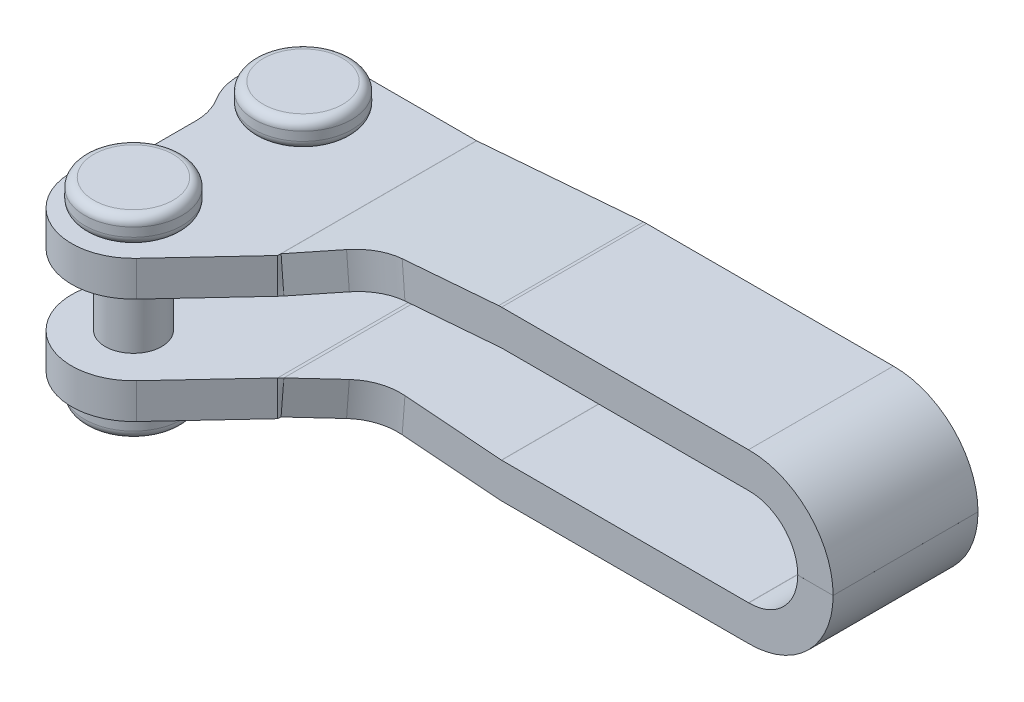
ISO-10303-21;
HEADER;
FILE_DESCRIPTION(('STEP AP214'),'2;1');
FILE_NAME('part.step','',(''),(''),'','','');
FILE_SCHEMA(('AUTOMOTIVE_DESIGN { 1 0 10303 214 1 1 1 1 }'));
ENDSEC;
DATA;
#1=APPLICATION_CONTEXT('core data for automotive mechanical design processes');
#2=APPLICATION_PROTOCOL_DEFINITION('international standard','automotive_design',2000,#1);
#3=PRODUCT_CONTEXT('',#1,'mechanical');
#4=PRODUCT('Part','Part','',(#3));
#5=PRODUCT_RELATED_PRODUCT_CATEGORY('part','',(#4));
#6=PRODUCT_DEFINITION_FORMATION('','',#4);
#7=PRODUCT_DEFINITION_CONTEXT('part definition',#1,'design');
#8=PRODUCT_DEFINITION('design','',#6,#7);
#9=PRODUCT_DEFINITION_SHAPE('','',#8);
#10=(LENGTH_UNIT() NAMED_UNIT(*) SI_UNIT(.MILLI.,.METRE.));
#11=(NAMED_UNIT(*) PLANE_ANGLE_UNIT() SI_UNIT($,.RADIAN.));
#12=(NAMED_UNIT(*) SI_UNIT($,.STERADIAN.) SOLID_ANGLE_UNIT());
#13=UNCERTAINTY_MEASURE_WITH_UNIT(LENGTH_MEASURE(1.E-05),#10,'distance_accuracy_value','');
#14=(GEOMETRIC_REPRESENTATION_CONTEXT(3) GLOBAL_UNCERTAINTY_ASSIGNED_CONTEXT((#13)) GLOBAL_UNIT_ASSIGNED_CONTEXT((#10,
#11,#12)) REPRESENTATION_CONTEXT('',''));
#15=CARTESIAN_POINT('',(0.,0.,0.));
#16=DIRECTION('',(0.,0.,1.));
#17=DIRECTION('',(1.,0.,0.));
#18=AXIS2_PLACEMENT_3D('',#15,#16,#17);
#19=CARTESIAN_POINT('',(0.,4.5,0.));
#20=DIRECTION('',(0.,-1.,0.));
#21=DIRECTION('',(0.950807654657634,0.,-0.309781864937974));
#22=AXIS2_PLACEMENT_3D('',#19,#20,#21);
#23=CYLINDRICAL_SURFACE('',#22,1.6);
#24=CARTESIAN_POINT('',(0.,2.,0.));
#25=DIRECTION('',(0.,-1.,0.));
#26=DIRECTION('',(1.,0.,0.));
#27=AXIS2_PLACEMENT_3D('',#24,#25,#26);
#28=CIRCLE('',#27,1.6);
#29=CARTESIAN_POINT('',(1.6,2.,0.));
#30=VERTEX_POINT('',#29);
#31=EDGE_CURVE('E24',#30,#30,#28,.F.);
#32=ORIENTED_EDGE('',*,*,#31,.F.);
#33=EDGE_LOOP('',(#32));
#34=FACE_BOUND('',#33,.T.);
#35=CARTESIAN_POINT('',(0.,-2.,0.));
#36=DIRECTION('',(0.,-1.,0.));
#37=DIRECTION('',(1.,0.,0.));
#38=AXIS2_PLACEMENT_3D('',#35,#36,#37);
#39=CIRCLE('',#38,1.6);
#40=CARTESIAN_POINT('',(1.59999997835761,-2.,-0.000263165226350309));
#41=VERTEX_POINT('',#40);
#42=CARTESIAN_POINT('',(-1.5999999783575,-2.,-0.000263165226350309));
#43=VERTEX_POINT('',#42);
#44=EDGE_CURVE('E18',#41,#43,#39,.T.);
#45=ORIENTED_EDGE('',*,*,#44,.F.);
#46=DIRECTION('',(0.,-1.,0.));
#47=VECTOR('',#46,1.);
#48=CARTESIAN_POINT('',(1.59999997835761,-3.,-0.000263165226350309));
#49=LINE('',#48,#47);
#50=CARTESIAN_POINT('',(1.59999997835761,-4.,-0.000263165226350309));
#51=VERTEX_POINT('',#50);
#52=EDGE_CURVE('E1423',#41,#51,#49,.T.);
#53=ORIENTED_EDGE('',*,*,#52,.T.);
#54=CARTESIAN_POINT('',(0.,-4.,0.));
#55=DIRECTION('',(0.,1.,0.));
#56=DIRECTION('',(0.99999998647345,0.,-0.000164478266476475));
#57=AXIS2_PLACEMENT_3D('',#54,#55,#56);
#58=CIRCLE('',#57,1.6);
#59=CARTESIAN_POINT('',(-1.5999999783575,-4.,-0.000263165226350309));
#60=VERTEX_POINT('',#59);
#61=EDGE_CURVE('E9',#51,#60,#58,.T.);
#62=ORIENTED_EDGE('',*,*,#61,.T.);
#63=DIRECTION('',(0.,-1.,0.));
#64=VECTOR('',#63,1.);
#65=CARTESIAN_POINT('',(-1.5999999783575,-3.,-0.000263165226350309));
#66=LINE('',#65,#64);
#67=EDGE_CURVE('E31',#60,#43,#66,.F.);
#68=ORIENTED_EDGE('',*,*,#67,.T.);
#69=EDGE_LOOP('',(#45,#53,#62,#68));
#70=FACE_BOUND('',#69,.T.);
#71=ADVANCED_FACE('F14',(#34,#70),#23,.T.);
#72=CARTESIAN_POINT('',(0.,-5.5,0.));
#73=DIRECTION('',(0.,1.,0.));
#74=DIRECTION('',(-0.950807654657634,0.,0.309781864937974));
#75=AXIS2_PLACEMENT_3D('',#72,#73,#74);
#76=PLANE('',#75);
#77=CARTESIAN_POINT('',(0.,-5.5,0.));
#78=DIRECTION('',(0.,1.,0.));
#79=DIRECTION('',(-0.950807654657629,0.,0.309781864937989));
#80=AXIS2_PLACEMENT_3D('',#77,#78,#79);
#81=CIRCLE('',#80,2.24999999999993);
#82=CARTESIAN_POINT('',(-2.13931722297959,-5.5,0.697009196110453));
#83=VERTEX_POINT('',#82);
#84=CARTESIAN_POINT('',(2.13931722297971,-5.5,-0.697009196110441));
#85=VERTEX_POINT('',#84);
#86=EDGE_CURVE('E1440',#83,#85,#81,.T.);
#87=ORIENTED_EDGE('',*,*,#86,.F.);
#88=CARTESIAN_POINT('',(0.,-5.5,0.));
#89=DIRECTION('',(0.,1.,0.));
#90=DIRECTION('',(0.950807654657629,0.,-0.309781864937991));
#91=AXIS2_PLACEMENT_3D('',#88,#89,#90);
#92=CIRCLE('',#91,2.24999999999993);
#93=EDGE_CURVE('E1443',#85,#83,#92,.T.);
#94=ORIENTED_EDGE('',*,*,#93,.F.);
#95=EDGE_LOOP('',(#87,#94));
#96=FACE_BOUND('',#95,.T.);
#97=ADVANCED_FACE('F1381',(#96),#76,.F.);
#98=CARTESIAN_POINT('',(0.,-5.,0.));
#99=DIRECTION('',(0.,1.,0.));
#100=DIRECTION('',(-0.950807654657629,0.,0.309781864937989));
#101=AXIS2_PLACEMENT_3D('',#98,#99,#100);
#102=TOROIDAL_SURFACE('',#101,2.24999999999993,0.5);
#103=ORIENTED_EDGE('',*,*,#86,.T.);
#104=ORIENTED_EDGE('',*,*,#93,.T.);
#105=EDGE_LOOP('',(#103,#104));
#106=FACE_BOUND('',#105,.T.);
#107=CARTESIAN_POINT('',(0.,-5.,0.));
#108=DIRECTION('',(0.,-1.,0.));
#109=DIRECTION('',(0.950807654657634,0.,-0.309781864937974));
#110=AXIS2_PLACEMENT_3D('',#107,#108,#109);
#111=CIRCLE('',#110,2.75);
#112=CARTESIAN_POINT('',(2.61472105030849,-5.,-0.85190012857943));
#113=VERTEX_POINT('',#112);
#114=EDGE_CURVE('E1372',#113,#113,#111,.F.);
#115=ORIENTED_EDGE('',*,*,#114,.F.);
#116=EDGE_LOOP('',(#115));
#117=FACE_BOUND('',#116,.T.);
#118=ADVANCED_FACE('F1377',(#106,#117),#102,.T.);
#119=CARTESIAN_POINT('',(0.,-4.,0.));
#120=DIRECTION('',(0.,-1.,0.));
#121=DIRECTION('',(0.950807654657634,0.,-0.309781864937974));
#122=AXIS2_PLACEMENT_3D('',#119,#120,#121);
#123=CYLINDRICAL_SURFACE('',#122,2.75);
#124=CARTESIAN_POINT('',(0.,-4.5,0.));
#125=DIRECTION('',(0.,1.,0.));
#126=DIRECTION('',(-0.950807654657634,0.,0.309781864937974));
#127=AXIS2_PLACEMENT_3D('',#124,#125,#126);
#128=CIRCLE('',#127,2.75);
#129=CARTESIAN_POINT('',(-2.61472105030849,-4.5,0.85190012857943));
#130=VERTEX_POINT('',#129);
#131=EDGE_CURVE('E1361',#130,#130,#128,.T.);
#132=ORIENTED_EDGE('',*,*,#131,.F.);
#133=EDGE_LOOP('',(#132));
#134=FACE_BOUND('',#133,.T.);
#135=ORIENTED_EDGE('',*,*,#114,.T.);
#136=EDGE_LOOP('',(#135));
#137=FACE_BOUND('',#136,.T.);
#138=ADVANCED_FACE('F1337',(#134,#137),#123,.T.);
#139=CARTESIAN_POINT('',(0.,-4.5,0.));
#140=DIRECTION('',(0.,1.,0.));
#141=DIRECTION('',(-0.950807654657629,0.,0.309781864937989));
#142=AXIS2_PLACEMENT_3D('',#139,#140,#141);
#143=TOROIDAL_SURFACE('',#142,2.24999999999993,0.5);
#144=ORIENTED_EDGE('',*,*,#131,.T.);
#145=EDGE_LOOP('',(#144));
#146=FACE_BOUND('',#145,.T.);
#147=CARTESIAN_POINT('',(0.,-4.,0.));
#148=DIRECTION('',(0.,-1.,0.));
#149=DIRECTION('',(-0.950807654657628,0.,0.309781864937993));
#150=AXIS2_PLACEMENT_3D('',#147,#148,#149);
#151=CIRCLE('',#150,2.24999999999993);
#152=CARTESIAN_POINT('',(2.13931722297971,-4.,-0.697009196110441));
#153=VERTEX_POINT('',#152);
#154=CARTESIAN_POINT('',(-2.13931722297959,-4.,0.697009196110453));
#155=VERTEX_POINT('',#154);
#156=EDGE_CURVE('E1304',#153,#155,#151,.F.);
#157=ORIENTED_EDGE('',*,*,#156,.F.);
#158=CARTESIAN_POINT('',(0.,-4.,0.));
#159=DIRECTION('',(0.,-1.,0.));
#160=DIRECTION('',(0.950807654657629,0.,-0.309781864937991));
#161=AXIS2_PLACEMENT_3D('',#158,#159,#160);
#162=CIRCLE('',#161,2.24999999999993);
#163=EDGE_CURVE('E1308',#155,#153,#162,.F.);
#164=ORIENTED_EDGE('',*,*,#163,.F.);
#165=EDGE_LOOP('',(#157,#164));
#166=FACE_BOUND('',#165,.T.);
#167=ADVANCED_FACE('F545',(#146,#166),#143,.T.);
#168=CARTESIAN_POINT('',(0.,5.5,0.));
#169=DIRECTION('',(0.,-1.,0.));
#170=DIRECTION('',(0.950807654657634,0.,-0.309781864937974));
#171=AXIS2_PLACEMENT_3D('',#168,#169,#170);
#172=PLANE('',#171);
#173=CARTESIAN_POINT('',(0.,5.5,0.));
#174=DIRECTION('',(0.,-1.,0.));
#175=DIRECTION('',(0.950807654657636,0.,-0.30978186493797));
#176=AXIS2_PLACEMENT_3D('',#173,#174,#175);
#177=CIRCLE('',#176,2.25000000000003);
#178=CARTESIAN_POINT('',(2.13931722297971,5.5,-0.697009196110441));
#179=VERTEX_POINT('',#178);
#180=CARTESIAN_POINT('',(-2.13931722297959,5.5,0.697009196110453));
#181=VERTEX_POINT('',#180);
#182=EDGE_CURVE('E676',#179,#181,#177,.T.);
#183=ORIENTED_EDGE('',*,*,#182,.F.);
#184=CARTESIAN_POINT('',(0.,5.5,0.));
#185=DIRECTION('',(0.,-1.,0.));
#186=DIRECTION('',(-0.950807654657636,0.,0.309781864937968));
#187=AXIS2_PLACEMENT_3D('',#184,#185,#186);
#188=CIRCLE('',#187,2.25000000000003);
#189=EDGE_CURVE('E1446',#181,#179,#188,.T.);
#190=ORIENTED_EDGE('',*,*,#189,.F.);
#191=EDGE_LOOP('',(#183,#190));
#192=FACE_BOUND('',#191,.T.);
#193=ADVANCED_FACE('F1336',(#192),#172,.F.);
#194=CARTESIAN_POINT('',(0.,5.,0.));
#195=DIRECTION('',(0.,-1.,0.));
#196=DIRECTION('',(0.950807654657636,0.,-0.30978186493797));
#197=AXIS2_PLACEMENT_3D('',#194,#195,#196);
#198=TOROIDAL_SURFACE('',#197,2.25000000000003,0.5);
#199=ORIENTED_EDGE('',*,*,#182,.T.);
#200=ORIENTED_EDGE('',*,*,#189,.T.);
#201=EDGE_LOOP('',(#199,#200));
#202=FACE_BOUND('',#201,.T.);
#203=CARTESIAN_POINT('',(0.,5.,0.));
#204=DIRECTION('',(0.,1.,0.));
#205=DIRECTION('',(-0.950807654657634,0.,0.309781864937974));
#206=AXIS2_PLACEMENT_3D('',#203,#204,#205);
#207=CIRCLE('',#206,2.75);
#208=CARTESIAN_POINT('',(-2.61472105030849,5.,0.85190012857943));
#209=VERTEX_POINT('',#208);
#210=EDGE_CURVE('E1448',#209,#209,#207,.F.);
#211=ORIENTED_EDGE('',*,*,#210,.F.);
#212=EDGE_LOOP('',(#211));
#213=FACE_BOUND('',#212,.T.);
#214=ADVANCED_FACE('F1383',(#202,#213),#198,.T.);
#215=CARTESIAN_POINT('',(0.,4.,0.));
#216=DIRECTION('',(0.,1.,0.));
#217=DIRECTION('',(-0.950807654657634,0.,0.309781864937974));
#218=AXIS2_PLACEMENT_3D('',#215,#216,#217);
#219=CYLINDRICAL_SURFACE('',#218,2.75);
#220=CARTESIAN_POINT('',(0.,4.5,0.));
#221=DIRECTION('',(0.,-1.,0.));
#222=DIRECTION('',(0.950807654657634,0.,-0.309781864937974));
#223=AXIS2_PLACEMENT_3D('',#220,#221,#222);
#224=CIRCLE('',#223,2.75);
#225=CARTESIAN_POINT('',(2.61472105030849,4.5,-0.85190012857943));
#226=VERTEX_POINT('',#225);
#227=EDGE_CURVE('E1369',#226,#226,#224,.T.);
#228=ORIENTED_EDGE('',*,*,#227,.F.);
#229=EDGE_LOOP('',(#228));
#230=FACE_BOUND('',#229,.T.);
#231=ORIENTED_EDGE('',*,*,#210,.T.);
#232=EDGE_LOOP('',(#231));
#233=FACE_BOUND('',#232,.T.);
#234=ADVANCED_FACE('F542',(#230,#233),#219,.T.);
#235=CARTESIAN_POINT('',(0.,4.5,0.));
#236=DIRECTION('',(0.,-1.,0.));
#237=DIRECTION('',(0.950807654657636,0.,-0.30978186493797));
#238=AXIS2_PLACEMENT_3D('',#235,#236,#237);
#239=TOROIDAL_SURFACE('',#238,2.25000000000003,0.5);
#240=ORIENTED_EDGE('',*,*,#227,.T.);
#241=EDGE_LOOP('',(#240));
#242=FACE_BOUND('',#241,.T.);
#243=CARTESIAN_POINT('',(0.,4.,0.));
#244=DIRECTION('',(0.,1.,0.));
#245=DIRECTION('',(0.950807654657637,0.,-0.309781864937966));
#246=AXIS2_PLACEMENT_3D('',#243,#244,#245);
#247=CIRCLE('',#246,2.25000000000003);
#248=CARTESIAN_POINT('',(-2.13931722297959,4.,0.697009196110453));
#249=VERTEX_POINT('',#248);
#250=CARTESIAN_POINT('',(2.13931722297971,4.,-0.697009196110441));
#251=VERTEX_POINT('',#250);
#252=EDGE_CURVE('E1316',#249,#251,#247,.F.);
#253=ORIENTED_EDGE('',*,*,#252,.F.);
#254=CARTESIAN_POINT('',(0.,4.,0.));
#255=DIRECTION('',(0.,1.,0.));
#256=DIRECTION('',(-0.950807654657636,0.,0.309781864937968));
#257=AXIS2_PLACEMENT_3D('',#254,#255,#256);
#258=CIRCLE('',#257,2.25000000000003);
#259=EDGE_CURVE('E401',#251,#249,#258,.F.);
#260=ORIENTED_EDGE('',*,*,#259,.F.);
#261=EDGE_LOOP('',(#253,#260));
#262=FACE_BOUND('',#261,.T.);
#263=ADVANCED_FACE('F530',(#242,#262),#239,.T.);
#264=CARTESIAN_POINT('',(-0.0999999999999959,5.5,9.49947366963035));
#265=DIRECTION('',(0.,-1.,0.));
#266=DIRECTION('',(0.950807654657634,0.,-0.309781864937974));
#267=AXIS2_PLACEMENT_3D('',#264,#265,#266);
#268=PLANE('',#267);
#269=CARTESIAN_POINT('',(-0.0999999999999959,5.5,9.49947366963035));
#270=DIRECTION('',(0.,-1.,0.));
#271=DIRECTION('',(0.950807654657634,0.,-0.309781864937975));
#272=AXIS2_PLACEMENT_3D('',#269,#270,#271);
#273=CIRCLE('',#272,2.25000000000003);
#274=CARTESIAN_POINT('',(2.03931722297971,5.5,8.8024644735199));
#275=VERTEX_POINT('',#274);
#276=CARTESIAN_POINT('',(-2.2393172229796,5.5,10.1964828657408));
#277=VERTEX_POINT('',#276);
#278=EDGE_CURVE('E663',#275,#277,#273,.T.);
#279=ORIENTED_EDGE('',*,*,#278,.F.);
#280=CARTESIAN_POINT('',(-0.0999999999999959,5.5,9.49947366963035));
#281=DIRECTION('',(0.,-1.,0.));
#282=DIRECTION('',(-0.950807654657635,0.,0.309781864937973));
#283=AXIS2_PLACEMENT_3D('',#280,#281,#282);
#284=CIRCLE('',#283,2.25000000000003);
#285=EDGE_CURVE('E1987',#277,#275,#284,.T.);
#286=ORIENTED_EDGE('',*,*,#285,.F.);
#287=EDGE_LOOP('',(#279,#286));
#288=FACE_BOUND('',#287,.T.);
#289=ADVANCED_FACE('F527',(#288),#268,.F.);
#290=CARTESIAN_POINT('',(-0.0999999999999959,-5.5,9.49947366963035));
#291=DIRECTION('',(0.,1.,0.));
#292=DIRECTION('',(-0.950807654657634,0.,0.309781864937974));
#293=AXIS2_PLACEMENT_3D('',#290,#291,#292);
#294=PLANE('',#293);
#295=CARTESIAN_POINT('',(-0.0999999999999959,-5.5,9.49947366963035));
#296=DIRECTION('',(0.,1.,0.));
#297=DIRECTION('',(-0.950807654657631,0.,0.309781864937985));
#298=AXIS2_PLACEMENT_3D('',#295,#296,#297);
#299=CIRCLE('',#298,2.24999999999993);
#300=CARTESIAN_POINT('',(-2.2393172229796,-5.5,10.1964828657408));
#301=VERTEX_POINT('',#300);
#302=CARTESIAN_POINT('',(2.03931722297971,-5.5,8.8024644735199));
#303=VERTEX_POINT('',#302);
#304=EDGE_CURVE('E2004',#301,#303,#299,.T.);
#305=ORIENTED_EDGE('',*,*,#304,.F.);
#306=CARTESIAN_POINT('',(-0.0999999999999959,-5.5,9.49947366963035));
#307=DIRECTION('',(0.,1.,0.));
#308=DIRECTION('',(0.95080765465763,0.,-0.309781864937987));
#309=AXIS2_PLACEMENT_3D('',#306,#307,#308);
#310=CIRCLE('',#309,2.24999999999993);
#311=EDGE_CURVE('E2005',#303,#301,#310,.T.);
#312=ORIENTED_EDGE('',*,*,#311,.F.);
#313=EDGE_LOOP('',(#305,#312));
#314=FACE_BOUND('',#313,.T.);
#315=ADVANCED_FACE('F529',(#314),#294,.F.);
#316=CARTESIAN_POINT('',(-0.0999999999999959,5.,9.49947366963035));
#317=DIRECTION('',(0.,-1.,0.));
#318=DIRECTION('',(0.950807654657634,0.,-0.309781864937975));
#319=AXIS2_PLACEMENT_3D('',#316,#317,#318);
#320=TOROIDAL_SURFACE('',#319,2.25000000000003,0.5);
#321=ORIENTED_EDGE('',*,*,#278,.T.);
#322=ORIENTED_EDGE('',*,*,#285,.T.);
#323=EDGE_LOOP('',(#321,#322));
#324=FACE_BOUND('',#323,.T.);
#325=CARTESIAN_POINT('',(-0.0999999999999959,5.,9.49947366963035));
#326=DIRECTION('',(0.,1.,0.));
#327=DIRECTION('',(-0.950807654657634,0.,0.309781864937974));
#328=AXIS2_PLACEMENT_3D('',#325,#326,#327);
#329=CIRCLE('',#328,2.75);
#330=CARTESIAN_POINT('',(-2.71472105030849,5.,10.3513737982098));
#331=VERTEX_POINT('',#330);
#332=EDGE_CURVE('E2008',#331,#331,#329,.F.);
#333=ORIENTED_EDGE('',*,*,#332,.F.);
#334=EDGE_LOOP('',(#333));
#335=FACE_BOUND('',#334,.T.);
#336=ADVANCED_FACE('F533',(#324,#335),#320,.T.);
#337=CARTESIAN_POINT('',(-0.0999999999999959,-5.,9.49947366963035));
#338=DIRECTION('',(0.,1.,0.));
#339=DIRECTION('',(-0.95080765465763,0.,0.309781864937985));
#340=AXIS2_PLACEMENT_3D('',#337,#338,#339);
#341=TOROIDAL_SURFACE('',#340,2.24999999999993,0.5);
#342=ORIENTED_EDGE('',*,*,#304,.T.);
#343=ORIENTED_EDGE('',*,*,#311,.T.);
#344=EDGE_LOOP('',(#342,#343));
#345=FACE_BOUND('',#344,.T.);
#346=CARTESIAN_POINT('',(-0.0999999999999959,-5.,9.49947366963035));
#347=DIRECTION('',(0.,-1.,0.));
#348=DIRECTION('',(0.950807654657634,0.,-0.309781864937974));
#349=AXIS2_PLACEMENT_3D('',#346,#347,#348);
#350=CIRCLE('',#349,2.75);
#351=CARTESIAN_POINT('',(2.5147210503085,-5.,8.64757354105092));
#352=VERTEX_POINT('',#351);
#353=EDGE_CURVE('E640',#352,#352,#350,.F.);
#354=ORIENTED_EDGE('',*,*,#353,.F.);
#355=EDGE_LOOP('',(#354));
#356=FACE_BOUND('',#355,.T.);
#357=ADVANCED_FACE('F541',(#345,#356),#341,.T.);
#358=CARTESIAN_POINT('',(6.4,2.,4.69947366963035));
#359=DIRECTION('',(0.,0.,-1.));
#360=DIRECTION('',(0.,1.,0.));
#361=AXIS2_PLACEMENT_3D('',#358,#359,#360);
#362=PLANE('',#361);
#363=DIRECTION('',(-0.0784449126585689,0.996918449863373,0.));
#364=VECTOR('',#363,1.);
#365=CARTESIAN_POINT('',(10.4661556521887,2.31995518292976,4.69947366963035));
#366=LINE('',#365,#364);
#367=CARTESIAN_POINT('',(10.4661556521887,2.31995518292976,4.69947366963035));
#368=VERTEX_POINT('',#367);
#369=CARTESIAN_POINT('',(10.3092658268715,4.3137920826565,4.69947366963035));
#370=VERTEX_POINT('',#369);
#371=EDGE_CURVE('E1117',#368,#370,#366,.T.);
#372=ORIENTED_EDGE('',*,*,#371,.F.);
#373=DIRECTION('',(-0.996918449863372,-0.0784449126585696,0.));
#374=VECTOR('',#373,1.);
#375=CARTESIAN_POINT('',(15.9255129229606,2.7495377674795,4.69947366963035));
#376=LINE('',#375,#374);
#377=CARTESIAN_POINT('',(15.9255129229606,2.7495377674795,4.69947366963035));
#378=VERTEX_POINT('',#377);
#379=EDGE_CURVE('E1120',#378,#368,#376,.T.);
#380=ORIENTED_EDGE('',*,*,#379,.F.);
#381=CARTESIAN_POINT('',(15.9372796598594,2.6,4.69947366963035));
#382=DIRECTION('',(0.,0.,1.));
#383=DIRECTION('',(0.,-1.,0.));
#384=AXIS2_PLACEMENT_3D('',#381,#382,#383);
#385=CIRCLE('',#384,0.15);
#386=CARTESIAN_POINT('',(15.9372796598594,2.75,4.69947366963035));
#387=VERTEX_POINT('',#386);
#388=EDGE_CURVE('E1032',#378,#387,#385,.F.);
#389=ORIENTED_EDGE('',*,*,#388,.T.);
#390=DIRECTION('',(1.,0.,0.));
#391=VECTOR('',#390,1.);
#392=CARTESIAN_POINT('',(15.9313872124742,2.75,4.69947366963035));
#393=LINE('',#392,#391);
#394=CARTESIAN_POINT('',(29.909954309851,2.75,4.69947366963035));
#395=VERTEX_POINT('',#394);
#396=EDGE_CURVE('E1044',#395,#387,#393,.F.);
#397=ORIENTED_EDGE('',*,*,#396,.F.);
#398=CARTESIAN_POINT('',(29.909954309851,4.9,4.69947366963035));
#399=DIRECTION('',(0.,0.,1.));
#400=DIRECTION('',(0.,-1.,0.));
#401=AXIS2_PLACEMENT_3D('',#398,#399,#400);
#402=CIRCLE('',#401,2.15);
#403=CARTESIAN_POINT('',(29.9275253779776,2.75007180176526,4.69947366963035));
#404=VERTEX_POINT('',#403);
#405=EDGE_CURVE('E1046',#395,#404,#402,.T.);
#406=ORIENTED_EDGE('',*,*,#405,.T.);
#407=CARTESIAN_POINT('',(29.95,0.000163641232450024,4.69947366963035));
#408=DIRECTION('',(0.,0.,1.));
#409=DIRECTION('',(0.,-1.,0.));
#410=AXIS2_PLACEMENT_3D('',#407,#408,#409);
#411=CIRCLE('',#410,2.75);
#412=CARTESIAN_POINT('',(32.7,0.000163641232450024,4.69947366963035));
#413=VERTEX_POINT('',#412);
#414=EDGE_CURVE('E350',#404,#413,#411,.F.);
#415=ORIENTED_EDGE('',*,*,#414,.T.);
#416=DIRECTION('',(1.,0.,0.));
#417=VECTOR('',#416,1.);
#418=CARTESIAN_POINT('',(29.95,0.000163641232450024,4.69947366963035));
#419=LINE('',#418,#417);
#420=CARTESIAN_POINT('',(34.7,0.000163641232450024,4.69947366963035));
#421=VERTEX_POINT('',#420);
#422=EDGE_CURVE('E330',#413,#421,#419,.T.);
#423=ORIENTED_EDGE('',*,*,#422,.T.);
#424=CARTESIAN_POINT('',(29.95,0.000163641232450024,4.69947366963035));
#425=DIRECTION('',(0.,0.,1.));
#426=DIRECTION('',(0.,-1.,0.));
#427=AXIS2_PLACEMENT_3D('',#424,#425,#426);
#428=CIRCLE('',#427,4.75);
#429=CARTESIAN_POINT('',(29.9111801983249,4.75000500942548,4.69947366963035));
#430=VERTEX_POINT('',#429);
#431=EDGE_CURVE('E1052',#430,#421,#428,.F.);
#432=ORIENTED_EDGE('',*,*,#431,.F.);
#433=DIRECTION('',(1.,0.,0.));
#434=VECTOR('',#433,1.);
#435=CARTESIAN_POINT('',(29.909954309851,4.75000500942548,4.69947366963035));
#436=LINE('',#435,#434);
#437=CARTESIAN_POINT('',(29.909954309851,4.75000250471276,4.69947366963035));
#438=VERTEX_POINT('',#437);
#439=EDGE_CURVE('E1042',#430,#438,#436,.F.);
#440=ORIENTED_EDGE('',*,*,#439,.T.);
#441=DIRECTION('',(-1.,0.,0.));
#442=VECTOR('',#441,1.);
#443=CARTESIAN_POINT('',(15.9313872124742,4.75,4.69947366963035));
#444=LINE('',#443,#442);
#445=CARTESIAN_POINT('',(15.9372796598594,4.75,4.69947366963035));
#446=VERTEX_POINT('',#445);
#447=EDGE_CURVE('E1035',#438,#446,#444,.T.);
#448=ORIENTED_EDGE('',*,*,#447,.T.);
#449=CARTESIAN_POINT('',(15.9372796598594,2.6,4.69947366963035));
#450=DIRECTION('',(0.,0.,1.));
#451=DIRECTION('',(0.,-1.,0.));
#452=AXIS2_PLACEMENT_3D('',#449,#450,#451);
#453=CIRCLE('',#452,2.15);
#454=CARTESIAN_POINT('',(15.7686230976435,4.74337466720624,4.69947366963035));
#455=VERTEX_POINT('',#454);
#456=EDGE_CURVE('E1030',#455,#446,#453,.F.);
#457=ORIENTED_EDGE('',*,*,#456,.F.);
#458=DIRECTION('',(-0.996918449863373,-0.0784449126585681,0.));
#459=VECTOR('',#458,1.);
#460=CARTESIAN_POINT('',(6.2431101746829,3.99383689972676,4.69947366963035));
#461=LINE('',#460,#459);
#462=EDGE_CURVE('E985',#455,#370,#461,.T.);
#463=ORIENTED_EDGE('',*,*,#462,.T.);
#464=EDGE_LOOP('',(#372,#380,#389,#397,#406,#415,#423,#432,#440,#448,#457,#463));
#465=FACE_BOUND('',#464,.T.);
#466=ADVANCED_FACE('F555',(#465),#362,.F.);
#467=CARTESIAN_POINT('',(10.3092658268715,4.3137920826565,4.69947366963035));
#468=CARTESIAN_POINT('',(10.4661556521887,2.31995518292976,4.69947366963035));
#469=CARTESIAN_POINT('',(9.46509046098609,4.24736612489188,4.69947366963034));
#470=CARTESIAN_POINT('',(9.62198028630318,2.25352922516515,4.69947366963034));
#471=CARTESIAN_POINT('',(8.69093093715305,4.18644953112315,5.03608781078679));
#472=CARTESIAN_POINT('',(8.84782076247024,2.19261263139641,5.03608781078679));
#473=CARTESIAN_POINT('',(8.11520472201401,4.14114713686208,5.65347858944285));
#474=CARTESIAN_POINT('',(8.2720945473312,2.14731023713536,5.65347858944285));
#475=(BOUNDED_SURFACE() B_SPLINE_SURFACE(3,1,((#467,#468),(#469,#470),(#471,#472),(#473,#474)),
.UNSPECIFIED.,.F.,.F.,.F.) B_SPLINE_SURFACE_WITH_KNOTS((4,4),(2,2),(0.,1.),(0.,1.),
.UNSPECIFIED.) GEOMETRIC_REPRESENTATION_ITEM() RATIONAL_B_SPLINE_SURFACE(((1.,1.),
(0.944706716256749,0.944706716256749),(0.944706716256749,0.944706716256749),(1.,1.))) REPRESENTATION_ITEM('') SURFACE());
#476=CARTESIAN_POINT('',(10.4661556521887,2.31995518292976,4.69947366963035));
#477=CARTESIAN_POINT('',(10.3814927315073,2.31329327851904,4.69946555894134));
#478=CARTESIAN_POINT('',(10.29683340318,2.30663165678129,4.70305749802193));
#479=CARTESIAN_POINT('',(10.1281176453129,2.29335585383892,4.71737952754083));
#480=CARTESIAN_POINT('',(10.0440612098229,2.28674167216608,4.72810954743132));
#481=CARTESIAN_POINT('',(9.87710957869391,2.27360468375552,4.75665189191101));
#482=CARTESIAN_POINT('',(9.79421489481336,2.26708191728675,4.77446724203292));
#483=CARTESIAN_POINT('',(9.6302420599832,2.25417932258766,4.81703872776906));
#484=CARTESIAN_POINT('',(9.54916382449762,2.24779948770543,4.84179453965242));
#485=CARTESIAN_POINT('',(9.30959982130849,2.22894882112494,4.92621167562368));
#486=CARTESIAN_POINT('',(9.15455646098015,2.21674886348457,4.99606196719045));
#487=CARTESIAN_POINT('',(8.85867786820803,2.19346694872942,5.16084476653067));
#488=CARTESIAN_POINT('',(8.71781831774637,2.18238307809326,5.25573329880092));
#489=CARTESIAN_POINT('',(8.5302866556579,2.16762670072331,5.40653912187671));
#490=CARTESIAN_POINT('',(8.47615788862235,2.16336744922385,5.45335862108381));
#491=CARTESIAN_POINT('',(8.37144045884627,2.15512750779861,5.55069166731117));
#492=CARTESIAN_POINT('',(8.32084724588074,2.1511464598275,5.60120028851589));
#493=CARTESIAN_POINT('',(8.2720945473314,2.14731023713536,5.6534785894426));
#494=B_SPLINE_CURVE_WITH_KNOTS('',3,(#476,#477,#478,#479,#480,#481,#482,#483,#484,#485,#486,
#487,#488,#489,#490,#491,#492,#493),.UNSPECIFIED.,.F.,.F.,(4,2,2,2,2,2,2,2,4),(0.,
0.254691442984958,0.509380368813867,0.764178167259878,1.01896408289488,1.52784779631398,
2.03584362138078,2.25077589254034,2.46542624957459),.UNSPECIFIED.);
#495=CARTESIAN_POINT('',(8.27209454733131,2.14731023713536,5.65347858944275));
#496=VERTEX_POINT('',#495);
#497=EDGE_CURVE('E1021',#368,#496,#494,.T.);
#498=CARTESIAN_POINT('',(10.3092658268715,4.3137920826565,4.69947366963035));
#499=CARTESIAN_POINT('',(10.2246029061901,4.30713017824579,4.69946555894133));
#500=CARTESIAN_POINT('',(10.1399435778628,4.30046855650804,4.70305749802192));
#501=CARTESIAN_POINT('',(9.97122781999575,4.28719275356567,4.71737952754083));
#502=CARTESIAN_POINT('',(9.88717138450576,4.28057857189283,4.72810954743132));
#503=CARTESIAN_POINT('',(9.72021975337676,4.26744158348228,4.75665189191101));
#504=CARTESIAN_POINT('',(9.63732506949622,4.26091881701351,4.77446724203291));
#505=CARTESIAN_POINT('',(9.47335223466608,4.24801622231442,4.81703872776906));
#506=CARTESIAN_POINT('',(9.39227399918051,4.24163638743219,4.84179453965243));
#507=CARTESIAN_POINT('',(9.15270999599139,4.2227857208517,4.92621167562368));
#508=CARTESIAN_POINT('',(8.99766663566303,4.21058576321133,4.99606196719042));
#509=CARTESIAN_POINT('',(8.70178804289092,4.18730384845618,5.16084476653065));
#510=CARTESIAN_POINT('',(8.56092849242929,4.17621997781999,5.25573329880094));
#511=CARTESIAN_POINT('',(8.37339683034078,4.16146360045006,5.40653912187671));
#512=CARTESIAN_POINT('',(8.3192680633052,4.15720434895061,5.4533586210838));
#513=CARTESIAN_POINT('',(8.21455063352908,4.14896440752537,5.55069166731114));
#514=CARTESIAN_POINT('',(8.16395742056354,4.14498335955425,5.60120028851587));
#515=CARTESIAN_POINT('',(8.11520472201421,4.1411471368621,5.6534785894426));
#516=B_SPLINE_CURVE_WITH_KNOTS('',3,(#498,#499,#500,#501,#502,#503,#504,#505,#506,#507,#508,
#509,#510,#511,#512,#513,#514,#515),.UNSPECIFIED.,.F.,.F.,(4,2,2,2,2,2,2,2,4),(0.,
0.254691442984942,0.509380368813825,0.764178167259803,1.01896408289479,1.52784779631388,
2.03584362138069,2.25077589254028,2.46542624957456),.UNSPECIFIED.);
#517=CARTESIAN_POINT('',(8.11520472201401,4.14114713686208,5.65347858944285));
#518=VERTEX_POINT('',#517);
#519=EDGE_CURVE('E988',#370,#518,#516,.T.);
#520=DIRECTION('',(0.078444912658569,-0.996918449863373,0.));
#521=VECTOR('',#520,1.);
#522=CARTESIAN_POINT('',(8.11520472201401,4.14114713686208,5.65347858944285));
#523=LINE('',#522,#521);
#524=EDGE_CURVE('E1114',#518,#496,#523,.T.);
#525=ORIENTED_EDGE('',*,*,#497,.F.);
#526=ORIENTED_EDGE('',*,*,#371,.T.);
#527=ORIENTED_EDGE('',*,*,#519,.T.);
#528=ORIENTED_EDGE('',*,*,#524,.T.);
#529=EDGE_LOOP('',(#525,#526,#527,#528));
#530=FACE_BOUND('',#529,.T.);
#531=ADVANCED_FACE('F873',(#530),#475,.T.);
#532=CARTESIAN_POINT('',(11.9512088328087,2.4368101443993,1.7081115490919));
#533=DIRECTION('',(-0.728052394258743,-0.057288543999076,-0.683123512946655));
#534=DIRECTION('',(-0.684247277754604,0.,0.729250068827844));
#535=AXIS2_PLACEMENT_3D('',#532,#533,#534);
#536=PLANE('',#535);
#537=ORIENTED_EDGE('',*,*,#524,.F.);
#538=DIRECTION('',(-0.681018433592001,-0.0535875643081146,0.730302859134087));
#539=VECTOR('',#538,1.);
#540=CARTESIAN_POINT('',(8.11520472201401,4.14114713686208,5.65347858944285));
#541=LINE('',#540,#539);
#542=CARTESIAN_POINT('',(6.3273083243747,4.0004622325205,7.57076274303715));
#543=VERTEX_POINT('',#542);
#544=EDGE_CURVE('E1100',#518,#543,#541,.T.);
#545=ORIENTED_EDGE('',*,*,#544,.T.);
#546=DIRECTION('',(-0.0784449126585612,0.996918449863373,0.));
#547=VECTOR('',#546,1.);
#548=CARTESIAN_POINT('',(6.40575323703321,3.00354378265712,7.57076274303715));
#549=LINE('',#548,#547);
#550=CARTESIAN_POINT('',(6.4841981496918,2.00662533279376,7.57076274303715));
#551=VERTEX_POINT('',#550);
#552=EDGE_CURVE('E984',#551,#543,#549,.T.);
#553=ORIENTED_EDGE('',*,*,#552,.F.);
#554=DIRECTION('',(-0.681018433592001,-0.0535875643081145,0.730302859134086));
#555=VECTOR('',#554,1.);
#556=CARTESIAN_POINT('',(8.2720945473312,2.14731023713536,5.65347858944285));
#557=LINE('',#556,#555);
#558=EDGE_CURVE('E1110',#496,#551,#557,.T.);
#559=ORIENTED_EDGE('',*,*,#558,.F.);
#560=EDGE_LOOP('',(#537,#545,#553,#559));
#561=FACE_BOUND('',#560,.T.);
#562=ADVANCED_FACE('F868',(#561),#536,.F.);
#563=CARTESIAN_POINT('',(6.2431101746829,-3.99383689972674,4.69947366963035));
#564=DIRECTION('',(0.,0.,-1.));
#565=DIRECTION('',(0.,1.,0.));
#566=AXIS2_PLACEMENT_3D('',#563,#564,#565);
#567=PLANE('',#566);
#568=DIRECTION('',(-0.996918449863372,0.0784449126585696,0.));
#569=VECTOR('',#568,1.);
#570=CARTESIAN_POINT('',(15.7686230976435,-4.74337466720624,4.69947366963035));
#571=LINE('',#570,#569);
#572=CARTESIAN_POINT('',(15.7686230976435,-4.74337466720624,4.69947366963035));
#573=VERTEX_POINT('',#572);
#574=CARTESIAN_POINT('',(10.3092658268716,-4.31379208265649,4.69947366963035));
#575=VERTEX_POINT('',#574);
#576=EDGE_CURVE('E737',#573,#575,#571,.T.);
#577=ORIENTED_EDGE('',*,*,#576,.F.);
#578=CARTESIAN_POINT('',(15.9372796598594,-2.6,4.69947366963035));
#579=DIRECTION('',(0.,0.,-1.));
#580=DIRECTION('',(0.,1.,0.));
#581=AXIS2_PLACEMENT_3D('',#578,#579,#580);
#582=CIRCLE('',#581,2.15);
#583=CARTESIAN_POINT('',(15.9372796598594,-4.75,4.69947366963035));
#584=VERTEX_POINT('',#583);
#585=EDGE_CURVE('E766',#573,#584,#582,.F.);
#586=ORIENTED_EDGE('',*,*,#585,.T.);
#587=DIRECTION('',(1.,0.,0.));
#588=VECTOR('',#587,1.);
#589=CARTESIAN_POINT('',(15.9313872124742,-4.75,4.69947366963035));
#590=LINE('',#589,#588);
#591=CARTESIAN_POINT('',(29.9099543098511,-4.75,4.69947366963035));
#592=VERTEX_POINT('',#591);
#593=EDGE_CURVE('E777',#592,#584,#590,.F.);
#594=ORIENTED_EDGE('',*,*,#593,.F.);
#595=DIRECTION('',(1.,0.,0.));
#596=VECTOR('',#595,1.);
#597=CARTESIAN_POINT('',(29.9099543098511,-4.75,4.69947366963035));
#598=LINE('',#597,#596);
#599=CARTESIAN_POINT('',(29.9111802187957,-4.75000250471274,4.69947366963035));
#600=VERTEX_POINT('',#599);
#601=EDGE_CURVE('E787',#592,#600,#598,.T.);
#602=ORIENTED_EDGE('',*,*,#601,.T.);
#603=CARTESIAN_POINT('',(29.95,-0.000163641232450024,4.69947366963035));
#604=DIRECTION('',(0.,0.,-1.));
#605=DIRECTION('',(0.,1.,0.));
#606=AXIS2_PLACEMENT_3D('',#603,#604,#605);
#607=CIRCLE('',#606,4.75);
#608=CARTESIAN_POINT('',(34.7,-0.000163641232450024,4.69947366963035));
#609=VERTEX_POINT('',#608);
#610=EDGE_CURVE('E794',#600,#609,#607,.F.);
#611=ORIENTED_EDGE('',*,*,#610,.T.);
#612=DIRECTION('',(1.,0.,0.));
#613=VECTOR('',#612,1.);
#614=CARTESIAN_POINT('',(29.95,-0.000163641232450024,4.69947366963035));
#615=LINE('',#614,#613);
#616=CARTESIAN_POINT('',(32.7,-0.000163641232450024,4.69947366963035));
#617=VERTEX_POINT('',#616);
#618=EDGE_CURVE('E791',#609,#617,#615,.F.);
#619=ORIENTED_EDGE('',*,*,#618,.T.);
#620=CARTESIAN_POINT('',(29.95,-0.000163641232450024,4.69947366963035));
#621=DIRECTION('',(0.,0.,-1.));
#622=DIRECTION('',(0.,1.,0.));
#623=AXIS2_PLACEMENT_3D('',#620,#621,#622);
#624=CIRCLE('',#623,2.75);
#625=CARTESIAN_POINT('',(29.9275253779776,-2.75007180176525,4.69947366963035));
#626=VERTEX_POINT('',#625);
#627=EDGE_CURVE('E797',#617,#626,#624,.T.);
#628=ORIENTED_EDGE('',*,*,#627,.T.);
#629=CARTESIAN_POINT('',(29.9099543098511,-4.9,4.69947366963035));
#630=DIRECTION('',(0.,0.,1.));
#631=DIRECTION('',(0.,-1.,0.));
#632=AXIS2_PLACEMENT_3D('',#629,#630,#631);
#633=CIRCLE('',#632,2.15);
#634=CARTESIAN_POINT('',(29.9099543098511,-2.75,4.69947366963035));
#635=VERTEX_POINT('',#634);
#636=EDGE_CURVE('E898',#626,#635,#633,.T.);
#637=ORIENTED_EDGE('',*,*,#636,.T.);
#638=DIRECTION('',(-1.,0.,0.));
#639=VECTOR('',#638,1.);
#640=CARTESIAN_POINT('',(15.9313872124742,-2.75,4.69947366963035));
#641=LINE('',#640,#639);
#642=CARTESIAN_POINT('',(15.9372796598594,-2.75,4.69947366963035));
#643=VERTEX_POINT('',#642);
#644=EDGE_CURVE('E773',#643,#635,#641,.F.);
#645=ORIENTED_EDGE('',*,*,#644,.F.);
#646=CARTESIAN_POINT('',(15.9372796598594,-2.6,4.69947366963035));
#647=DIRECTION('',(0.,0.,1.));
#648=DIRECTION('',(0.,-1.,0.));
#649=AXIS2_PLACEMENT_3D('',#646,#647,#648);
#650=CIRCLE('',#649,0.15);
#651=CARTESIAN_POINT('',(15.9255129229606,-2.74953776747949,4.69947366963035));
#652=VERTEX_POINT('',#651);
#653=EDGE_CURVE('E776',#643,#652,#650,.F.);
#654=ORIENTED_EDGE('',*,*,#653,.T.);
#655=DIRECTION('',(-0.996918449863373,0.0784449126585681,0.));
#656=VECTOR('',#655,1.);
#657=CARTESIAN_POINT('',(6.4,-2.,4.69947366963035));
#658=LINE('',#657,#656);
#659=CARTESIAN_POINT('',(10.4661556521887,-2.31995518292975,4.69947366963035));
#660=VERTEX_POINT('',#659);
#661=EDGE_CURVE('E450',#660,#652,#658,.F.);
#662=ORIENTED_EDGE('',*,*,#661,.F.);
#663=DIRECTION('',(0.0784449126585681,0.996918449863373,0.));
#664=VECTOR('',#663,1.);
#665=CARTESIAN_POINT('',(10.3092658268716,-4.31379208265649,4.69947366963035));
#666=LINE('',#665,#664);
#667=EDGE_CURVE('E484',#575,#660,#666,.T.);
#668=ORIENTED_EDGE('',*,*,#667,.F.);
#669=EDGE_LOOP('',(#577,#586,#594,#602,#611,#619,#628,#637,#645,#654,#662,#668));
#670=FACE_BOUND('',#669,.T.);
#671=ADVANCED_FACE('F464',(#670),#567,.F.);
#672=CARTESIAN_POINT('',(8.11520472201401,-4.14114713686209,5.65347858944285));
#673=CARTESIAN_POINT('',(8.2720945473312,-2.14731023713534,5.65347858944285));
#674=CARTESIAN_POINT('',(8.69093093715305,-4.18644953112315,5.03608781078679));
#675=CARTESIAN_POINT('',(8.84782076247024,-2.19261263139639,5.03608781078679));
#676=CARTESIAN_POINT('',(9.46509046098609,-4.24736612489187,4.69947366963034));
#677=CARTESIAN_POINT('',(9.62198028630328,-2.25352922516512,4.69947366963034));
#678=CARTESIAN_POINT('',(10.3092658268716,-4.31379208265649,4.69947366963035));
#679=CARTESIAN_POINT('',(10.4661556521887,-2.31995518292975,4.69947366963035));
#680=(BOUNDED_SURFACE() B_SPLINE_SURFACE(3,1,((#672,#673),(#674,#675),(#676,#677),(#678,#679)),
.UNSPECIFIED.,.F.,.F.,.F.) B_SPLINE_SURFACE_WITH_KNOTS((4,4),(2,2),(0.,1.),(0.,1.),
.UNSPECIFIED.) GEOMETRIC_REPRESENTATION_ITEM() RATIONAL_B_SPLINE_SURFACE(((1.,1.),
(0.944706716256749,0.944706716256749),(0.944706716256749,0.944706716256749),(1.,1.))) REPRESENTATION_ITEM('') SURFACE());
#681=CARTESIAN_POINT('',(8.2720945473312,-2.14731023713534,5.65347858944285));
#682=CARTESIAN_POINT('',(8.32993996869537,-2.15186194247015,5.59143472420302));
#683=CARTESIAN_POINT('',(8.39041830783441,-2.15662082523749,5.53186707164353));
#684=CARTESIAN_POINT('',(8.51617900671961,-2.16651660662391,5.41807735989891));
#685=CARTESIAN_POINT('',(8.58146122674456,-2.17165349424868,5.36385514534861));
#686=CARTESIAN_POINT('',(8.71638396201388,-2.18227021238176,5.26113617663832));
#687=CARTESIAN_POINT('',(8.78602529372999,-2.18775010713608,5.21264050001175));
#688=CARTESIAN_POINT('',(8.92912279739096,-2.19901007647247,5.12173767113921));
#689=CARTESIAN_POINT('',(9.00257880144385,-2.20479013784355,5.07933025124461));
#690=CARTESIAN_POINT('',(9.22732733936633,-2.22247501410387,4.96200423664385));
#691=CARTESIAN_POINT('',(9.38363532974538,-2.23477448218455,4.89649998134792));
#692=CARTESIAN_POINT('',(9.70473547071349,-2.26004101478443,4.79281659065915));
#693=CARTESIAN_POINT('',(9.86951328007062,-2.2730069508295,4.75459279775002));
#694=CARTESIAN_POINT('',(10.1073895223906,-2.29172481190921,4.72013015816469));
#695=CARTESIAN_POINT('',(10.1789738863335,-2.29735759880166,4.71238289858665));
#696=CARTESIAN_POINT('',(10.3224141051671,-2.30864453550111,4.70205902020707));
#697=CARTESIAN_POINT('',(10.3942694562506,-2.31429864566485,4.69947535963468));
#698=CARTESIAN_POINT('',(10.4661556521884,-2.31995518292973,4.69947366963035));
#699=B_SPLINE_CURVE_WITH_KNOTS('',3,(#681,#682,#683,#684,#685,#686,#687,#688,#689,#690,#691,
#692,#693,#694,#695,#696,#697,#698),.UNSPECIFIED.,.F.,.F.,(4,2,2,2,2,2,2,2,4),(0.,
0.254761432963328,0.509515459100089,0.764317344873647,1.01910802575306,1.52632404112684,
2.03270783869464,2.24922056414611,2.46543782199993),.UNSPECIFIED.);
#700=CARTESIAN_POINT('',(8.2720945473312,-2.14731023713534,5.65347858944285));
#701=VERTEX_POINT('',#700);
#702=EDGE_CURVE('E441',#701,#660,#699,.T.);
#703=DIRECTION('',(-0.0784449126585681,-0.996918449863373,0.));
#704=VECTOR('',#703,1.);
#705=CARTESIAN_POINT('',(8.2720945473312,-2.14731023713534,5.65347858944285));
#706=LINE('',#705,#704);
#707=CARTESIAN_POINT('',(8.1152047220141,-4.14114713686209,5.65347858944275));
#708=VERTEX_POINT('',#707);
#709=EDGE_CURVE('E730',#701,#708,#706,.T.);
#710=CARTESIAN_POINT('',(10.3092658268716,-4.31379208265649,4.69947366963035));
#711=CARTESIAN_POINT('',(10.2246029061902,-4.30713017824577,4.69946555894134));
#712=CARTESIAN_POINT('',(10.1399435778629,-4.30046855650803,4.70305749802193));
#713=CARTESIAN_POINT('',(9.97122781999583,-4.28719275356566,4.71737952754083));
#714=CARTESIAN_POINT('',(9.88717138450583,-4.28057857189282,4.72810954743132));
#715=CARTESIAN_POINT('',(9.72021975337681,-4.26744158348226,4.75665189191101));
#716=CARTESIAN_POINT('',(9.63732506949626,-4.26091881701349,4.77446724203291));
#717=CARTESIAN_POINT('',(9.47335223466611,-4.2480162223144,4.81703872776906));
#718=CARTESIAN_POINT('',(9.39227399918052,-4.24163638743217,4.84179453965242));
#719=CARTESIAN_POINT('',(9.15270999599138,-4.22278572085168,4.92621167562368));
#720=CARTESIAN_POINT('',(8.99766663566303,-4.2105857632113,4.99606196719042));
#721=CARTESIAN_POINT('',(8.70178804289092,-4.18730384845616,5.16084476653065));
#722=CARTESIAN_POINT('',(8.56092849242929,-4.17621997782,5.25573329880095));
#723=CARTESIAN_POINT('',(8.37339683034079,-4.16146360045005,5.4065391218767));
#724=CARTESIAN_POINT('',(8.31926806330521,-4.15720434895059,5.45335862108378));
#725=CARTESIAN_POINT('',(8.21455063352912,-4.14896440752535,5.55069166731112));
#726=CARTESIAN_POINT('',(8.1639574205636,-4.14498335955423,5.60120028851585));
#727=CARTESIAN_POINT('',(8.1152047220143,-4.1411471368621,5.6534785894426));
#728=B_SPLINE_CURVE_WITH_KNOTS('',3,(#710,#711,#712,#713,#714,#715,#716,#717,#718,#719,#720,
#721,#722,#723,#724,#725,#726,#727),.UNSPECIFIED.,.F.,.F.,(4,2,2,2,2,2,2,2,4),(0.,
0.254691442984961,0.509380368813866,0.764178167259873,1.01896408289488,1.52784779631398,
2.03584362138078,2.25077589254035,2.46542624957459),.UNSPECIFIED.);
#729=EDGE_CURVE('E477',#575,#708,#728,.T.);
#730=ORIENTED_EDGE('',*,*,#702,.F.);
#731=ORIENTED_EDGE('',*,*,#709,.T.);
#732=ORIENTED_EDGE('',*,*,#729,.F.);
#733=ORIENTED_EDGE('',*,*,#667,.T.);
#734=EDGE_LOOP('',(#730,#731,#732,#733));
#735=FACE_BOUND('',#734,.T.);
#736=ADVANCED_FACE('F456',(#735),#680,.T.);
#737=CARTESIAN_POINT('',(3.74493863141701,-1.79108014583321,10.5082589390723));
#738=DIRECTION('',(-0.728052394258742,0.057288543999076,-0.683123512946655));
#739=DIRECTION('',(0.684247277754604,0.,-0.729250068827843));
#740=AXIS2_PLACEMENT_3D('',#737,#738,#739);
#741=PLANE('',#740);
#742=DIRECTION('',(0.0784449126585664,0.996918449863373,0.));
#743=VECTOR('',#742,1.);
#744=CARTESIAN_POINT('',(6.40575323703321,-3.00354378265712,7.57076274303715));
#745=LINE('',#744,#743);
#746=CARTESIAN_POINT('',(6.3273083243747,-4.0004622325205,7.57076274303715));
#747=VERTEX_POINT('',#746);
#748=CARTESIAN_POINT('',(6.4841981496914,-2.00662533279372,7.57076274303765));
#749=VERTEX_POINT('',#748);
#750=EDGE_CURVE('E740',#747,#749,#745,.T.);
#751=ORIENTED_EDGE('',*,*,#750,.F.);
#752=DIRECTION('',(-0.681018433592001,0.0535875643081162,0.730302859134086));
#753=VECTOR('',#752,1.);
#754=CARTESIAN_POINT('',(8.11520472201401,-4.14114713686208,5.65347858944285));
#755=LINE('',#754,#753);
#756=EDGE_CURVE('E733',#708,#747,#755,.T.);
#757=ORIENTED_EDGE('',*,*,#756,.F.);
#758=ORIENTED_EDGE('',*,*,#709,.F.);
#759=DIRECTION('',(0.681018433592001,-0.0535875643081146,-0.730302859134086));
#760=VECTOR('',#759,1.);
#761=CARTESIAN_POINT('',(6.4841981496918,-2.00662533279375,7.57076274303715));
#762=LINE('',#761,#760);
#763=EDGE_CURVE('E718',#749,#701,#762,.T.);
#764=ORIENTED_EDGE('',*,*,#763,.F.);
#765=EDGE_LOOP('',(#751,#757,#758,#764));
#766=FACE_BOUND('',#765,.T.);
#767=ADVANCED_FACE('F463',(#766),#741,.F.);
#768=CARTESIAN_POINT('',(-0.0999999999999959,4.,9.49947366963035));
#769=DIRECTION('',(0.,1.,0.));
#770=DIRECTION('',(-0.950807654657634,0.,0.309781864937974));
#771=AXIS2_PLACEMENT_3D('',#768,#769,#770);
#772=CYLINDRICAL_SURFACE('',#771,2.75);
#773=CARTESIAN_POINT('',(-0.0999999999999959,4.5,9.49947366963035));
#774=DIRECTION('',(0.,-1.,0.));
#775=DIRECTION('',(0.950807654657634,0.,-0.309781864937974));
#776=AXIS2_PLACEMENT_3D('',#773,#774,#775);
#777=CIRCLE('',#776,2.75);
#778=CARTESIAN_POINT('',(2.5147210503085,4.5,8.64757354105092));
#779=VERTEX_POINT('',#778);
#780=EDGE_CURVE('E638',#779,#779,#777,.T.);
#781=ORIENTED_EDGE('',*,*,#780,.F.);
#782=EDGE_LOOP('',(#781));
#783=FACE_BOUND('',#782,.T.);
#784=ORIENTED_EDGE('',*,*,#332,.T.);
#785=EDGE_LOOP('',(#784));
#786=FACE_BOUND('',#785,.T.);
#787=ADVANCED_FACE('F551',(#783,#786),#772,.T.);
#788=CARTESIAN_POINT('',(-0.0999999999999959,-4.,9.49947366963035));
#789=DIRECTION('',(0.,-1.,0.));
#790=DIRECTION('',(0.950807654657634,0.,-0.309781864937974));
#791=AXIS2_PLACEMENT_3D('',#788,#789,#790);
#792=CYLINDRICAL_SURFACE('',#791,2.75);
#793=CARTESIAN_POINT('',(-0.0999999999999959,-4.5,9.49947366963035));
#794=DIRECTION('',(0.,1.,0.));
#795=DIRECTION('',(-0.950807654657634,0.,0.309781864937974));
#796=AXIS2_PLACEMENT_3D('',#793,#794,#795);
#797=CIRCLE('',#796,2.75);
#798=CARTESIAN_POINT('',(-2.71472105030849,-4.5,10.3513737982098));
#799=VERTEX_POINT('',#798);
#800=EDGE_CURVE('E630',#799,#799,#797,.T.);
#801=ORIENTED_EDGE('',*,*,#800,.F.);
#802=EDGE_LOOP('',(#801));
#803=FACE_BOUND('',#802,.T.);
#804=ORIENTED_EDGE('',*,*,#353,.T.);
#805=EDGE_LOOP('',(#804));
#806=FACE_BOUND('',#805,.T.);
#807=ADVANCED_FACE('F558',(#803,#806),#792,.T.);
#808=CARTESIAN_POINT('',(4.16554158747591,4.15,10.0572174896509));
#809=CARTESIAN_POINT('',(4.8322082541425,4.15,10.0572174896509));
#810=CARTESIAN_POINT('',(5.4988749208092,4.15,10.0572174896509));
#811=CARTESIAN_POINT('',(6.16554158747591,4.15,10.0572174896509));
#812=CARTESIAN_POINT('',(6.1722082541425,4.15,10.0572174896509));
#813=CARTESIAN_POINT('',(6.1788749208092,4.15,10.0572174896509));
#814=CARTESIAN_POINT('',(6.1855415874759,4.15,10.0572174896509));
#815=CARTESIAN_POINT('',(4.16554158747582,-0.14999999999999,10.0572174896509));
#816=CARTESIAN_POINT('',(4.83220825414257,1.18333333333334,10.0572174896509));
#817=CARTESIAN_POINT('',(5.49887492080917,2.51666666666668,10.0572174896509));
#818=CARTESIAN_POINT('',(6.16554158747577,3.84999999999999,10.0572174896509));
#819=CARTESIAN_POINT('',(6.17220825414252,3.86333333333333,10.0572174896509));
#820=CARTESIAN_POINT('',(6.17887492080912,3.87666666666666,10.0572174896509));
#821=CARTESIAN_POINT('',(6.18554158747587,3.89,10.0572174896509));
#822=CARTESIAN_POINT('',(8.46554158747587,-0.14999999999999,5.44603203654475));
#823=CARTESIAN_POINT('',(7.79887492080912,1.18333333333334,5.44603203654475));
#824=CARTESIAN_POINT('',(7.13220825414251,2.51666666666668,5.44603203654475));
#825=CARTESIAN_POINT('',(6.46554158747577,3.84999999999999,5.44603203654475));
#826=CARTESIAN_POINT('',(6.45887492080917,3.86333333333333,5.44603203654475));
#827=CARTESIAN_POINT('',(6.45220825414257,3.87666666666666,5.44603203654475));
#828=CARTESIAN_POINT('',(6.44554158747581,3.89,5.44603203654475));
#829=CARTESIAN_POINT('',(8.4655415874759,4.15,5.44603203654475));
#830=CARTESIAN_POINT('',(7.7988749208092,4.15,5.44603203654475));
#831=CARTESIAN_POINT('',(7.13220825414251,4.15,5.44603203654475));
#832=CARTESIAN_POINT('',(6.4655415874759,4.15,5.44603203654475));
#833=CARTESIAN_POINT('',(6.4588749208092,4.15,5.44603203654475));
#834=CARTESIAN_POINT('',(6.45220825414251,4.15,5.44603203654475));
#835=CARTESIAN_POINT('',(6.4455415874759,4.15,5.44603203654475));
#836=CARTESIAN_POINT('',(8.46554158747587,8.45,5.44603203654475));
#837=CARTESIAN_POINT('',(7.79887492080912,7.11666666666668,5.44603203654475));
#838=CARTESIAN_POINT('',(7.13220825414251,5.78333333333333,5.44603203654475));
#839=CARTESIAN_POINT('',(6.46554158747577,4.45000000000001,5.44603203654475));
#840=CARTESIAN_POINT('',(6.45887492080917,4.43666666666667,5.44603203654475));
#841=CARTESIAN_POINT('',(6.45220825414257,4.42333333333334,5.44603203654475));
#842=CARTESIAN_POINT('',(6.44554158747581,4.41,5.44603203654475));
#843=CARTESIAN_POINT('',(4.16554158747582,8.45,10.0572174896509));
#844=CARTESIAN_POINT('',(4.83220825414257,7.11666666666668,10.0572174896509));
#845=CARTESIAN_POINT('',(5.49887492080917,5.78333333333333,10.0572174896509));
#846=CARTESIAN_POINT('',(6.16554158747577,4.45000000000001,10.0572174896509));
#847=CARTESIAN_POINT('',(6.17220825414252,4.43666666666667,10.0572174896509));
#848=CARTESIAN_POINT('',(6.17887492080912,4.42333333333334,10.0572174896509));
#849=CARTESIAN_POINT('',(6.18554158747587,4.41,10.0572174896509));
#850=CARTESIAN_POINT('',(4.16554158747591,4.15,10.0572174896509));
#851=CARTESIAN_POINT('',(4.8322082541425,4.15,10.0572174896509));
#852=CARTESIAN_POINT('',(5.4988749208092,4.15,10.0572174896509));
#853=CARTESIAN_POINT('',(6.16554158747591,4.15,10.0572174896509));
#854=CARTESIAN_POINT('',(6.1722082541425,4.15,10.0572174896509));
#855=CARTESIAN_POINT('',(6.1788749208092,4.15,10.0572174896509));
#856=CARTESIAN_POINT('',(6.1855415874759,4.15,10.0572174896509));
#857=(BOUNDED_SURFACE() B_SPLINE_SURFACE(3,3,((#808,#809,#810,#811,#812,#813,#814),(#815,#816,
#817,#818,#819,#820,#821),(#822,#823,#824,#825,#826,#827,#828),(#829,#830,#831,#832,#833,#834,
#835),(#836,#837,#838,#839,#840,#841,#842),(#843,#844,#845,#846,#847,#848,#849),(#850,#851,#852,
#853,#854,#855,#856)),.UNSPECIFIED.,.T.,.F.,.F.) B_SPLINE_SURFACE_WITH_KNOTS((4,3,4),(4,3,4),
(0.,0.5,1.),(0.,1.,1.01),
.UNSPECIFIED.) GEOMETRIC_REPRESENTATION_ITEM() RATIONAL_B_SPLINE_SURFACE(((1.,1.,1.,1.,1.,1.,
1.),(0.333333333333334,0.333333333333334,0.333333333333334,0.333333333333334,0.333333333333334,
0.333333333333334,0.333333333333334),(0.333333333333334,0.333333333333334,0.333333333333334,
0.333333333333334,0.333333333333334,0.333333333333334,0.333333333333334),(1.,1.,1.,1.,1.,1.,1.),
(0.333333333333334,0.333333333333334,0.333333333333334,0.333333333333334,0.333333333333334,
0.333333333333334,0.333333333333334),(0.333333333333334,0.333333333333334,0.333333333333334,
0.333333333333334,0.333333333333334,0.333333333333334,0.333333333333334),(1.,1.,1.,1.,1.,1.,1.))) REPRESENTATION_ITEM('') SURFACE());
#858=CARTESIAN_POINT('',(6.32730832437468,4.00046223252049,7.57076274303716));
#859=CARTESIAN_POINT('',(6.32681905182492,4.00042373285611,7.57829866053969));
#860=CARTESIAN_POINT('',(6.32632959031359,4.00038763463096,7.58583457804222));
#861=CARTESIAN_POINT('',(6.32535033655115,4.00032024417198,7.60090641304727));
#862=CARTESIAN_POINT('',(6.32486054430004,4.00028895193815,7.6084423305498));
#863=CARTESIAN_POINT('',(6.3238806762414,4.0002311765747,7.62351416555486));
#864=CARTESIAN_POINT('',(6.32339060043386,4.00020469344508,7.63105008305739));
#865=CARTESIAN_POINT('',(6.3224102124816,4.00015653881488,7.64612191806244));
#866=CARTESIAN_POINT('',(6.32191990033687,4.00013486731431,7.65365783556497));
#867=CARTESIAN_POINT('',(6.32093908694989,4.00009633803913,7.66872967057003));
#868=CARTESIAN_POINT('',(6.32044858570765,4.00007948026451,7.67626558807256));
#869=CARTESIAN_POINT('',(6.31946744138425,4.00005058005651,7.69133742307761));
#870=CARTESIAN_POINT('',(6.3189767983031,4.00003853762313,7.69887334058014));
#871=CARTESIAN_POINT('',(6.31799541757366,4.00001926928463,7.7139451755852));
#872=CARTESIAN_POINT('',(6.31750467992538,4.0000120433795,7.72148109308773));
#873=CARTESIAN_POINT('',(6.31652315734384,4.00000240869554,7.73655292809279));
#874=CARTESIAN_POINT('',(6.31603237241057,3.9999999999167,7.74408884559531));
#875=CARTESIAN_POINT('',(6.3155415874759,4.,7.75162476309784));
#876=B_SPLINE_CURVE_WITH_KNOTS('',3,(#858,#859,#860,#861,#862,#863,#864,#865,#866,#867,#868,
#869,#870,#871,#872,#873,#874,#875),.UNSPECIFIED.,.F.,.F.,(4,2,2,2,2,2,2,2,4),(0.,
0.0226556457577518,0.0453112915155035,0.0679669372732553,0.0906225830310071,0.113278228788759,
0.135933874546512,0.158589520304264,0.181245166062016),.UNSPECIFIED.);
#877=CARTESIAN_POINT('',(6.3155415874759,4.,7.75162476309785));
#878=VERTEX_POINT('',#877);
#879=EDGE_CURVE('E926',#543,#878,#876,.T.);
#880=DIRECTION('',(0.,1.,0.));
#881=VECTOR('',#880,1.);
#882=CARTESIAN_POINT('',(6.3155415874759,2.,7.75162476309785));
#883=LINE('',#882,#881);
#884=CARTESIAN_POINT('',(6.3155415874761,2.,7.7516247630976));
#885=VERTEX_POINT('',#884);
#886=EDGE_CURVE('E922',#878,#885,#883,.F.);
#887=CARTESIAN_POINT('',(6.3155415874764,2.,7.7516247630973));
#888=CARTESIAN_POINT('',(6.34367119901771,1.99999951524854,7.72145944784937));
#889=CARTESIAN_POINT('',(6.37179071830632,2.00055138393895,7.6913049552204));
#890=CARTESIAN_POINT('',(6.42800957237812,2.00275982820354,7.63101761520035));
#891=CARTESIAN_POINT('',(6.45610890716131,2.00441640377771,7.60088476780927));
#892=CARTESIAN_POINT('',(6.4841981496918,2.00662533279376,7.57076274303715));
#893=B_SPLINE_CURVE_WITH_KNOTS('',3,(#887,#888,#889,#890,#891,#892),.UNSPECIFIED.,.F.,.F.,(4,2,
4),(0.,0.123704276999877,0.247408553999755),.UNSPECIFIED.);
#894=EDGE_CURVE('E975',#885,#551,#893,.T.);
#895=ORIENTED_EDGE('',*,*,#879,.T.);
#896=ORIENTED_EDGE('',*,*,#886,.T.);
#897=ORIENTED_EDGE('',*,*,#894,.T.);
#898=ORIENTED_EDGE('',*,*,#552,.T.);
#899=EDGE_LOOP('',(#895,#896,#897,#898));
#900=FACE_BOUND('',#899,.T.);
#901=ADVANCED_FACE('F569',(#900),#857,.T.);
#902=CARTESIAN_POINT('',(6.4,2.,-3.50052633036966));
#903=DIRECTION('',(0.0784449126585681,-0.996918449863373,0.));
#904=DIRECTION('',(-0.996918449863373,-0.0784449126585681,0.));
#905=AXIS2_PLACEMENT_3D('',#902,#903,#904);
#906=PLANE('',#905);
#907=DIRECTION('',(0.,0.,1.));
#908=VECTOR('',#907,1.);
#909=CARTESIAN_POINT('',(6.4841981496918,2.00662533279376,-3.50052633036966));
#910=LINE('',#909,#908);
#911=CARTESIAN_POINT('',(6.4841981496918,2.00662533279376,-3.50052633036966));
#912=VERTEX_POINT('',#911);
#913=EDGE_CURVE('E1113',#912,#551,#910,.T.);
#914=ORIENTED_EDGE('',*,*,#913,.F.);
#915=DIRECTION('',(-0.996918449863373,-0.0784449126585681,0.));
#916=VECTOR('',#915,1.);
#917=CARTESIAN_POINT('',(15.9255129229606,2.7495377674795,-3.50052633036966));
#918=LINE('',#917,#916);
#919=CARTESIAN_POINT('',(15.9255129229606,2.7495377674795,-3.50052633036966));
#920=VERTEX_POINT('',#919);
#921=EDGE_CURVE('E1028',#920,#912,#918,.T.);
#922=ORIENTED_EDGE('',*,*,#921,.F.);
#923=DIRECTION('',(0.,0.,-1.));
#924=VECTOR('',#923,1.);
#925=CARTESIAN_POINT('',(15.9255129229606,2.7495377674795,-3.50052633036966));
#926=LINE('',#925,#924);
#927=EDGE_CURVE('E1029',#920,#378,#926,.F.);
#928=ORIENTED_EDGE('',*,*,#927,.T.);
#929=ORIENTED_EDGE('',*,*,#379,.T.);
#930=ORIENTED_EDGE('',*,*,#497,.T.);
#931=ORIENTED_EDGE('',*,*,#558,.T.);
#932=EDGE_LOOP('',(#914,#922,#928,#929,#930,#931));
#933=FACE_BOUND('',#932,.T.);
#934=ADVANCED_FACE('F965',(#933),#906,.T.);
#935=CARTESIAN_POINT('',(15.9372796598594,2.6,-3.50052633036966));
#936=DIRECTION('',(0.,0.,1.));
#937=DIRECTION('',(0.,-1.,0.));
#938=AXIS2_PLACEMENT_3D('',#935,#936,#937);
#939=CYLINDRICAL_SURFACE('',#938,0.15);
#940=ORIENTED_EDGE('',*,*,#388,.F.);
#941=ORIENTED_EDGE('',*,*,#927,.F.);
#942=CARTESIAN_POINT('',(15.9372796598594,2.6,-3.50052633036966));
#943=DIRECTION('',(0.,0.,-1.));
#944=DIRECTION('',(0.,1.,0.));
#945=AXIS2_PLACEMENT_3D('',#942,#943,#944);
#946=CIRCLE('',#945,0.15);
#947=CARTESIAN_POINT('',(15.9372796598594,2.75,-3.50052633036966));
#948=VERTEX_POINT('',#947);
#949=EDGE_CURVE('E1039',#948,#920,#946,.F.);
#950=ORIENTED_EDGE('',*,*,#949,.F.);
#951=DIRECTION('',(0.,0.,1.));
#952=VECTOR('',#951,1.);
#953=CARTESIAN_POINT('',(15.9372796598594,2.75,-3.50052633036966));
#954=LINE('',#953,#952);
#955=EDGE_CURVE('E1041',#387,#948,#954,.F.);
#956=ORIENTED_EDGE('',*,*,#955,.F.);
#957=EDGE_LOOP('',(#940,#941,#950,#956));
#958=FACE_BOUND('',#957,.T.);
#959=ADVANCED_FACE('F1160',(#958),#939,.F.);
#960=CARTESIAN_POINT('',(15.9313872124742,2.75,-3.50052633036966));
#961=DIRECTION('',(0.,-1.,0.));
#962=DIRECTION('',(-1.,0.,0.));
#963=AXIS2_PLACEMENT_3D('',#960,#961,#962);
#964=PLANE('',#963);
#965=ORIENTED_EDGE('',*,*,#955,.T.);
#966=DIRECTION('',(1.,0.,0.));
#967=VECTOR('',#966,1.);
#968=CARTESIAN_POINT('',(15.7686230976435,2.75,-3.50052633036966));
#969=LINE('',#968,#967);
#970=CARTESIAN_POINT('',(29.909954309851,2.75,-3.50052633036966));
#971=VERTEX_POINT('',#970);
#972=EDGE_CURVE('E1143',#971,#948,#969,.F.);
#973=ORIENTED_EDGE('',*,*,#972,.F.);
#974=DIRECTION('',(0.,0.,-1.));
#975=VECTOR('',#974,1.);
#976=CARTESIAN_POINT('',(29.909954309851,2.75,-3.50052633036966));
#977=LINE('',#976,#975);
#978=EDGE_CURVE('E1049',#971,#395,#977,.F.);
#979=ORIENTED_EDGE('',*,*,#978,.T.);
#980=ORIENTED_EDGE('',*,*,#396,.T.);
#981=EDGE_LOOP('',(#965,#973,#979,#980));
#982=FACE_BOUND('',#981,.T.);
#983=ADVANCED_FACE('F1148',(#982),#964,.T.);
#984=CARTESIAN_POINT('',(29.909954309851,4.9,-3.50052633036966));
#985=DIRECTION('',(0.,0.,1.));
#986=DIRECTION('',(0.,-1.,0.));
#987=AXIS2_PLACEMENT_3D('',#984,#985,#986);
#988=CYLINDRICAL_SURFACE('',#987,2.15);
#989=ORIENTED_EDGE('',*,*,#978,.F.);
#990=CARTESIAN_POINT('',(29.909954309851,4.9,-3.50052633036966));
#991=DIRECTION('',(0.,0.,-1.));
#992=DIRECTION('',(0.,1.,0.));
#993=AXIS2_PLACEMENT_3D('',#990,#991,#992);
#994=CIRCLE('',#993,2.15);
#995=CARTESIAN_POINT('',(29.9275253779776,2.75007180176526,-3.50052633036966));
#996=VERTEX_POINT('',#995);
#997=EDGE_CURVE('E1056',#996,#971,#994,.T.);
#998=ORIENTED_EDGE('',*,*,#997,.F.);
#999=DIRECTION('',(0.,0.,1.));
#1000=VECTOR('',#999,1.);
#1001=CARTESIAN_POINT('',(29.9275253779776,2.75007180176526,-3.50052633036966));
#1002=LINE('',#1001,#1000);
#1003=EDGE_CURVE('E345',#996,#404,#1002,.T.);
#1004=ORIENTED_EDGE('',*,*,#1003,.T.);
#1005=ORIENTED_EDGE('',*,*,#405,.F.);
#1006=EDGE_LOOP('',(#989,#998,#1004,#1005));
#1007=FACE_BOUND('',#1006,.T.);
#1008=ADVANCED_FACE('F1152',(#1007),#988,.T.);
#1009=CARTESIAN_POINT('',(29.95,0.000163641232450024,-3.50052633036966));
#1010=DIRECTION('',(0.,0.,1.));
#1011=DIRECTION('',(0.,-1.,0.));
#1012=AXIS2_PLACEMENT_3D('',#1009,#1010,#1011);
#1013=CYLINDRICAL_SURFACE('',#1012,2.75);
#1014=ORIENTED_EDGE('',*,*,#414,.F.);
#1015=ORIENTED_EDGE('',*,*,#1003,.F.);
#1016=CARTESIAN_POINT('',(29.95,0.000163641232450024,-3.50052633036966));
#1017=DIRECTION('',(0.,0.,1.));
#1018=DIRECTION('',(0.,-1.,0.));
#1019=AXIS2_PLACEMENT_3D('',#1016,#1017,#1018);
#1020=CIRCLE('',#1019,2.75);
#1021=CARTESIAN_POINT('',(32.7,0.000163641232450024,-3.50052633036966));
#1022=VERTEX_POINT('',#1021);
#1023=EDGE_CURVE('E335',#1022,#996,#1020,.T.);
#1024=ORIENTED_EDGE('',*,*,#1023,.F.);
#1025=DIRECTION('',(0.,0.,-1.));
#1026=VECTOR('',#1025,1.);
#1027=CARTESIAN_POINT('',(32.7,0.000163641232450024,-3.50052633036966));
#1028=LINE('',#1027,#1026);
#1029=EDGE_CURVE('E324',#413,#1022,#1028,.T.);
#1030=ORIENTED_EDGE('',*,*,#1029,.F.);
#1031=EDGE_LOOP('',(#1014,#1015,#1024,#1030));
#1032=FACE_BOUND('',#1031,.T.);
#1033=ADVANCED_FACE('F16',(#1032),#1013,.F.);
#1034=CARTESIAN_POINT('',(32.7,0.000163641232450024,-3.50052633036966));
#1035=DIRECTION('',(0.,-1.,0.));
#1036=DIRECTION('',(-1.,0.,0.));
#1037=AXIS2_PLACEMENT_3D('',#1034,#1035,#1036);
#1038=PLANE('',#1037);
#1039=ORIENTED_EDGE('',*,*,#1029,.T.);
#1040=DIRECTION('',(1.,0.,0.));
#1041=VECTOR('',#1040,1.);
#1042=CARTESIAN_POINT('',(29.909954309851,0.000163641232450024,-3.50052633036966));
#1043=LINE('',#1042,#1041);
#1044=CARTESIAN_POINT('',(34.7,0.000163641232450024,-3.50052633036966));
#1045=VERTEX_POINT('',#1044);
#1046=EDGE_CURVE('E328',#1045,#1022,#1043,.F.);
#1047=ORIENTED_EDGE('',*,*,#1046,.F.);
#1048=DIRECTION('',(0.,0.,1.));
#1049=VECTOR('',#1048,1.);
#1050=CARTESIAN_POINT('',(34.7,0.000163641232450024,-3.50052633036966));
#1051=LINE('',#1050,#1049);
#1052=EDGE_CURVE('E1051',#421,#1045,#1051,.F.);
#1053=ORIENTED_EDGE('',*,*,#1052,.F.);
#1054=ORIENTED_EDGE('',*,*,#422,.F.);
#1055=EDGE_LOOP('',(#1039,#1047,#1053,#1054));
#1056=FACE_BOUND('',#1055,.T.);
#1057=ADVANCED_FACE('F326',(#1056),#1038,.T.);
#1058=CARTESIAN_POINT('',(29.95,0.000163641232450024,-3.50052633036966));
#1059=DIRECTION('',(0.,0.,1.));
#1060=DIRECTION('',(0.,-1.,0.));
#1061=AXIS2_PLACEMENT_3D('',#1058,#1059,#1060);
#1062=CYLINDRICAL_SURFACE('',#1061,4.75);
#1063=CARTESIAN_POINT('',(29.95,0.000163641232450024,-3.50052633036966));
#1064=DIRECTION('',(0.,0.,1.));
#1065=DIRECTION('',(0.,-1.,0.));
#1066=AXIS2_PLACEMENT_3D('',#1063,#1064,#1065);
#1067=CIRCLE('',#1066,4.75);
#1068=CARTESIAN_POINT('',(29.9111802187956,4.75000250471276,-3.50052633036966));
#1069=VERTEX_POINT('',#1068);
#1070=EDGE_CURVE('E343',#1045,#1069,#1067,.T.);
#1071=ORIENTED_EDGE('',*,*,#1070,.T.);
#1072=DIRECTION('',(0.,0.,1.));
#1073=VECTOR('',#1072,1.);
#1074=CARTESIAN_POINT('',(29.9111801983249,4.75000500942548,-3.50052633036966));
#1075=LINE('',#1074,#1073);
#1076=EDGE_CURVE('E1045',#1069,#430,#1075,.T.);
#1077=ORIENTED_EDGE('',*,*,#1076,.T.);
#1078=ORIENTED_EDGE('',*,*,#431,.T.);
#1079=ORIENTED_EDGE('',*,*,#1052,.T.);
#1080=EDGE_LOOP('',(#1071,#1077,#1078,#1079));
#1081=FACE_BOUND('',#1080,.T.);
#1082=ADVANCED_FACE('F1155',(#1081),#1062,.T.);
#1083=CARTESIAN_POINT('',(29.909954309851,4.9,-3.50052633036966));
#1084=DIRECTION('',(0.,0.,1.));
#1085=DIRECTION('',(0.,-1.,0.));
#1086=AXIS2_PLACEMENT_3D('',#1083,#1084,#1085);
#1087=CYLINDRICAL_SURFACE('',#1086,0.15);
#1088=ORIENTED_EDGE('',*,*,#1076,.F.);
#1089=DIRECTION('',(1.,0.,0.));
#1090=VECTOR('',#1089,1.);
#1091=CARTESIAN_POINT('',(29.9275253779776,4.75,-3.50052633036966));
#1092=LINE('',#1091,#1090);
#1093=CARTESIAN_POINT('',(29.909954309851,4.75,-3.50052633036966));
#1094=VERTEX_POINT('',#1093);
#1095=EDGE_CURVE('E1055',#1094,#1069,#1092,.T.);
#1096=ORIENTED_EDGE('',*,*,#1095,.F.);
#1097=DIRECTION('',(0.,0.,-1.));
#1098=VECTOR('',#1097,1.);
#1099=CARTESIAN_POINT('',(29.909954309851,4.75,-3.50052633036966));
#1100=LINE('',#1099,#1098);
#1101=EDGE_CURVE('E1132',#1094,#438,#1100,.F.);
#1102=ORIENTED_EDGE('',*,*,#1101,.T.);
#1103=ORIENTED_EDGE('',*,*,#439,.F.);
#1104=EDGE_LOOP('',(#1088,#1096,#1102,#1103));
#1105=FACE_BOUND('',#1104,.T.);
#1106=ADVANCED_FACE('F1162',(#1105),#1087,.F.);
#1107=CARTESIAN_POINT('',(15.9313872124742,4.75,-3.50052633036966));
#1108=DIRECTION('',(0.,-1.,0.));
#1109=DIRECTION('',(-1.,0.,0.));
#1110=AXIS2_PLACEMENT_3D('',#1107,#1108,#1109);
#1111=PLANE('',#1110);
#1112=ORIENTED_EDGE('',*,*,#1101,.F.);
#1113=DIRECTION('',(-1.,0.,0.));
#1114=VECTOR('',#1113,1.);
#1115=CARTESIAN_POINT('',(15.9313872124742,4.75,-3.50052633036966));
#1116=LINE('',#1115,#1114);
#1117=CARTESIAN_POINT('',(15.9372796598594,4.75,-3.50052633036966));
#1118=VERTEX_POINT('',#1117);
#1119=EDGE_CURVE('E1038',#1118,#1094,#1116,.F.);
#1120=ORIENTED_EDGE('',*,*,#1119,.F.);
#1121=DIRECTION('',(0.,0.,1.));
#1122=VECTOR('',#1121,1.);
#1123=CARTESIAN_POINT('',(15.9372796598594,4.75,-3.50052633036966));
#1124=LINE('',#1123,#1122);
#1125=EDGE_CURVE('E1128',#446,#1118,#1124,.F.);
#1126=ORIENTED_EDGE('',*,*,#1125,.F.);
#1127=ORIENTED_EDGE('',*,*,#447,.F.);
#1128=EDGE_LOOP('',(#1112,#1120,#1126,#1127));
#1129=FACE_BOUND('',#1128,.T.);
#1130=ADVANCED_FACE('F1004',(#1129),#1111,.F.);
#1131=CARTESIAN_POINT('',(15.9372796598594,2.6,-3.50052633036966));
#1132=DIRECTION('',(0.,0.,1.));
#1133=DIRECTION('',(0.,-1.,0.));
#1134=AXIS2_PLACEMENT_3D('',#1131,#1132,#1133);
#1135=CYLINDRICAL_SURFACE('',#1134,2.15);
#1136=CARTESIAN_POINT('',(15.9372796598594,2.6,-3.50052633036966));
#1137=DIRECTION('',(0.,0.,1.));
#1138=DIRECTION('',(0.,-1.,0.));
#1139=AXIS2_PLACEMENT_3D('',#1136,#1137,#1138);
#1140=CIRCLE('',#1139,2.15);
#1141=CARTESIAN_POINT('',(15.7686230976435,4.74337466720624,-3.50052633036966));
#1142=VERTEX_POINT('',#1141);
#1143=EDGE_CURVE('E1036',#1142,#1118,#1140,.F.);
#1144=ORIENTED_EDGE('',*,*,#1143,.F.);
#1145=DIRECTION('',(0.,0.,-1.));
#1146=VECTOR('',#1145,1.);
#1147=CARTESIAN_POINT('',(15.7686230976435,4.74337466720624,-3.50052633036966));
#1148=LINE('',#1147,#1146);
#1149=EDGE_CURVE('E1099',#1142,#455,#1148,.F.);
#1150=ORIENTED_EDGE('',*,*,#1149,.T.);
#1151=ORIENTED_EDGE('',*,*,#456,.T.);
#1152=ORIENTED_EDGE('',*,*,#1125,.T.);
#1153=EDGE_LOOP('',(#1144,#1150,#1151,#1152));
#1154=FACE_BOUND('',#1153,.T.);
#1155=ADVANCED_FACE('F1002',(#1154),#1135,.T.);
#1156=CARTESIAN_POINT('',(6.2431101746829,3.99383689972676,-3.50052633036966));
#1157=DIRECTION('',(0.0784449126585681,-0.996918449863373,0.));
#1158=DIRECTION('',(-0.996918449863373,-0.0784449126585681,0.));
#1159=AXIS2_PLACEMENT_3D('',#1156,#1157,#1158);
#1160=PLANE('',#1159);
#1161=ORIENTED_EDGE('',*,*,#1149,.F.);
#1162=DIRECTION('',(-0.996918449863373,-0.0784449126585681,0.));
#1163=VECTOR('',#1162,1.);
#1164=CARTESIAN_POINT('',(6.2431101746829,3.99383689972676,-3.50052633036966));
#1165=LINE('',#1164,#1163);
#1166=CARTESIAN_POINT('',(6.3273083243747,4.0004622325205,-3.50052633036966));
#1167=VERTEX_POINT('',#1166);
#1168=EDGE_CURVE('E1103',#1167,#1142,#1165,.F.);
#1169=ORIENTED_EDGE('',*,*,#1168,.F.);
#1170=DIRECTION('',(0.,0.,1.));
#1171=VECTOR('',#1170,1.);
#1172=CARTESIAN_POINT('',(6.3273083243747,4.0004622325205,-3.50052633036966));
#1173=LINE('',#1172,#1171);
#1174=EDGE_CURVE('E933',#1167,#543,#1173,.T.);
#1175=ORIENTED_EDGE('',*,*,#1174,.T.);
#1176=ORIENTED_EDGE('',*,*,#544,.F.);
#1177=ORIENTED_EDGE('',*,*,#519,.F.);
#1178=ORIENTED_EDGE('',*,*,#462,.F.);
#1179=EDGE_LOOP('',(#1161,#1169,#1175,#1176,#1177,#1178));
#1180=FACE_BOUND('',#1179,.T.);
#1181=ADVANCED_FACE('F495',(#1180),#1160,.F.);
#1182=CARTESIAN_POINT('',(6.2431101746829,-3.99383689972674,12.9994736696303));
#1183=DIRECTION('',(0.0784449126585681,0.996918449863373,0.));
#1184=DIRECTION('',(-0.996918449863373,0.0784449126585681,0.));
#1185=AXIS2_PLACEMENT_3D('',#1182,#1183,#1184);
#1186=PLANE('',#1185);
#1187=ORIENTED_EDGE('',*,*,#729,.T.);
#1188=ORIENTED_EDGE('',*,*,#756,.T.);
#1189=DIRECTION('',(0.,0.,-1.));
#1190=VECTOR('',#1189,1.);
#1191=CARTESIAN_POINT('',(6.3273083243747,-4.0004622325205,12.9994736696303));
#1192=LINE('',#1191,#1190);
#1193=CARTESIAN_POINT('',(6.3273083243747,-4.0004622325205,-3.50052633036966));
#1194=VERTEX_POINT('',#1193);
#1195=EDGE_CURVE('E485',#747,#1194,#1192,.T.);
#1196=ORIENTED_EDGE('',*,*,#1195,.T.);
#1197=DIRECTION('',(-0.996918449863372,0.0784449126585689,0.));
#1198=VECTOR('',#1197,1.);
#1199=CARTESIAN_POINT('',(15.7686230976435,-4.74337466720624,-3.50052633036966));
#1200=LINE('',#1199,#1198);
#1201=CARTESIAN_POINT('',(15.7686230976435,-4.74337466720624,-3.50052633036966));
#1202=VERTEX_POINT('',#1201);
#1203=EDGE_CURVE('E734',#1202,#1194,#1200,.T.);
#1204=ORIENTED_EDGE('',*,*,#1203,.F.);
#1205=DIRECTION('',(0.,0.,1.));
#1206=VECTOR('',#1205,1.);
#1207=CARTESIAN_POINT('',(15.7686230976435,-4.74337466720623,12.9994736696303));
#1208=LINE('',#1207,#1206);
#1209=EDGE_CURVE('E748',#573,#1202,#1208,.F.);
#1210=ORIENTED_EDGE('',*,*,#1209,.F.);
#1211=ORIENTED_EDGE('',*,*,#576,.T.);
#1212=EDGE_LOOP('',(#1187,#1188,#1196,#1204,#1210,#1211));
#1213=FACE_BOUND('',#1212,.T.);
#1214=ADVANCED_FACE('F490',(#1213),#1186,.F.);
#1215=CARTESIAN_POINT('',(15.9372796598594,-2.6,12.9994736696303));
#1216=DIRECTION('',(0.,0.,-1.));
#1217=DIRECTION('',(0.,1.,0.));
#1218=AXIS2_PLACEMENT_3D('',#1215,#1216,#1217);
#1219=CYLINDRICAL_SURFACE('',#1218,2.15);
#1220=CARTESIAN_POINT('',(15.9372796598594,-2.6,-3.50052633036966));
#1221=DIRECTION('',(0.,0.,-1.));
#1222=DIRECTION('',(0.,1.,0.));
#1223=AXIS2_PLACEMENT_3D('',#1220,#1221,#1222);
#1224=CIRCLE('',#1223,2.15);
#1225=CARTESIAN_POINT('',(15.9372796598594,-4.75,-3.50052633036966));
#1226=VERTEX_POINT('',#1225);
#1227=EDGE_CURVE('E488',#1226,#1202,#1224,.T.);
#1228=ORIENTED_EDGE('',*,*,#1227,.F.);
#1229=DIRECTION('',(0.,0.,-1.));
#1230=VECTOR('',#1229,1.);
#1231=CARTESIAN_POINT('',(15.9372796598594,-4.75,12.9994736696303));
#1232=LINE('',#1231,#1230);
#1233=EDGE_CURVE('E763',#1226,#584,#1232,.F.);
#1234=ORIENTED_EDGE('',*,*,#1233,.T.);
#1235=ORIENTED_EDGE('',*,*,#585,.F.);
#1236=ORIENTED_EDGE('',*,*,#1209,.T.);
#1237=EDGE_LOOP('',(#1228,#1234,#1235,#1236));
#1238=FACE_BOUND('',#1237,.T.);
#1239=ADVANCED_FACE('F494',(#1238),#1219,.T.);
#1240=CARTESIAN_POINT('',(15.9313872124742,-4.75,12.9994736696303));
#1241=DIRECTION('',(0.,1.,0.));
#1242=DIRECTION('',(-1.,0.,0.));
#1243=AXIS2_PLACEMENT_3D('',#1240,#1241,#1242);
#1244=PLANE('',#1243);
#1245=ORIENTED_EDGE('',*,*,#1233,.F.);
#1246=DIRECTION('',(1.,0.,0.));
#1247=VECTOR('',#1246,1.);
#1248=CARTESIAN_POINT('',(29.911180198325,-4.75,-3.50052633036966));
#1249=LINE('',#1248,#1247);
#1250=CARTESIAN_POINT('',(29.9099543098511,-4.75000250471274,-3.50052633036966));
#1251=VERTEX_POINT('',#1250);
#1252=EDGE_CURVE('E767',#1251,#1226,#1249,.F.);
#1253=ORIENTED_EDGE('',*,*,#1252,.F.);
#1254=DIRECTION('',(0.,0.,1.));
#1255=VECTOR('',#1254,1.);
#1256=CARTESIAN_POINT('',(29.9099543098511,-4.75,12.9994736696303));
#1257=LINE('',#1256,#1255);
#1258=EDGE_CURVE('E780',#592,#1251,#1257,.F.);
#1259=ORIENTED_EDGE('',*,*,#1258,.F.);
#1260=ORIENTED_EDGE('',*,*,#593,.T.);
#1261=EDGE_LOOP('',(#1245,#1253,#1259,#1260));
#1262=FACE_BOUND('',#1261,.T.);
#1263=ADVANCED_FACE('F504',(#1262),#1244,.F.);
#1264=CARTESIAN_POINT('',(29.9099543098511,-4.9,12.9994736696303));
#1265=DIRECTION('',(0.,0.,-1.));
#1266=DIRECTION('',(0.,1.,0.));
#1267=AXIS2_PLACEMENT_3D('',#1264,#1265,#1266);
#1268=CYLINDRICAL_SURFACE('',#1267,0.15);
#1269=ORIENTED_EDGE('',*,*,#1258,.T.);
#1270=DIRECTION('',(1.,0.,0.));
#1271=VECTOR('',#1270,1.);
#1272=CARTESIAN_POINT('',(29.9099543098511,-4.75000500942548,-3.50052633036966));
#1273=LINE('',#1272,#1271);
#1274=CARTESIAN_POINT('',(29.911180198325,-4.75000500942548,-3.50052633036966));
#1275=VERTEX_POINT('',#1274);
#1276=EDGE_CURVE('E782',#1275,#1251,#1273,.F.);
#1277=ORIENTED_EDGE('',*,*,#1276,.F.);
#1278=DIRECTION('',(0.,0.,-1.));
#1279=VECTOR('',#1278,1.);
#1280=CARTESIAN_POINT('',(29.911180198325,-4.75000500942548,12.9994736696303));
#1281=LINE('',#1280,#1279);
#1282=EDGE_CURVE('E785',#600,#1275,#1281,.T.);
#1283=ORIENTED_EDGE('',*,*,#1282,.F.);
#1284=ORIENTED_EDGE('',*,*,#601,.F.);
#1285=EDGE_LOOP('',(#1269,#1277,#1283,#1284));
#1286=FACE_BOUND('',#1285,.T.);
#1287=ADVANCED_FACE('F512',(#1286),#1268,.F.);
#1288=CARTESIAN_POINT('',(29.95,-0.000163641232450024,12.9994736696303));
#1289=DIRECTION('',(0.,0.,-1.));
#1290=DIRECTION('',(0.,1.,0.));
#1291=AXIS2_PLACEMENT_3D('',#1288,#1289,#1290);
#1292=CYLINDRICAL_SURFACE('',#1291,4.75);
#1293=CARTESIAN_POINT('',(29.95,-0.000163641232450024,-3.50052633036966));
#1294=DIRECTION('',(0.,0.,-1.));
#1295=DIRECTION('',(0.,1.,0.));
#1296=AXIS2_PLACEMENT_3D('',#1293,#1294,#1295);
#1297=CIRCLE('',#1296,4.75);
#1298=CARTESIAN_POINT('',(34.7,-0.000163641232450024,-3.50052633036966));
#1299=VERTEX_POINT('',#1298);
#1300=EDGE_CURVE('E788',#1275,#1299,#1297,.F.);
#1301=ORIENTED_EDGE('',*,*,#1300,.T.);
#1302=DIRECTION('',(0.,0.,1.));
#1303=VECTOR('',#1302,1.);
#1304=CARTESIAN_POINT('',(34.7,-0.000163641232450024,12.9994736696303));
#1305=LINE('',#1304,#1303);
#1306=EDGE_CURVE('E799',#609,#1299,#1305,.F.);
#1307=ORIENTED_EDGE('',*,*,#1306,.F.);
#1308=ORIENTED_EDGE('',*,*,#610,.F.);
#1309=ORIENTED_EDGE('',*,*,#1282,.T.);
#1310=EDGE_LOOP('',(#1301,#1307,#1308,#1309));
#1311=FACE_BOUND('',#1310,.T.);
#1312=ADVANCED_FACE('F374',(#1311),#1292,.T.);
#1313=CARTESIAN_POINT('',(32.7,-0.000163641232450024,12.9994736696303));
#1314=DIRECTION('',(0.,1.,0.));
#1315=DIRECTION('',(-1.,0.,0.));
#1316=AXIS2_PLACEMENT_3D('',#1313,#1314,#1315);
#1317=PLANE('',#1316);
#1318=ORIENTED_EDGE('',*,*,#1306,.T.);
#1319=DIRECTION('',(1.,0.,0.));
#1320=VECTOR('',#1319,1.);
#1321=CARTESIAN_POINT('',(29.95,-0.000163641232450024,-3.50052633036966));
#1322=LINE('',#1321,#1320);
#1323=CARTESIAN_POINT('',(32.7,-0.000163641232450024,-3.50052633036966));
#1324=VERTEX_POINT('',#1323);
#1325=EDGE_CURVE('E789',#1299,#1324,#1322,.F.);
#1326=ORIENTED_EDGE('',*,*,#1325,.T.);
#1327=DIRECTION('',(0.,0.,-1.));
#1328=VECTOR('',#1327,1.);
#1329=CARTESIAN_POINT('',(32.7,-0.000163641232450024,12.9994736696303));
#1330=LINE('',#1329,#1328);
#1331=EDGE_CURVE('E795',#1324,#617,#1330,.F.);
#1332=ORIENTED_EDGE('',*,*,#1331,.T.);
#1333=ORIENTED_EDGE('',*,*,#618,.F.);
#1334=EDGE_LOOP('',(#1318,#1326,#1332,#1333));
#1335=FACE_BOUND('',#1334,.T.);
#1336=ADVANCED_FACE('F516',(#1335),#1317,.T.);
#1337=CARTESIAN_POINT('',(29.95,-0.000163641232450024,12.9994736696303));
#1338=DIRECTION('',(0.,0.,-1.));
#1339=DIRECTION('',(0.,1.,0.));
#1340=AXIS2_PLACEMENT_3D('',#1337,#1338,#1339);
#1341=CYLINDRICAL_SURFACE('',#1340,2.75);
#1342=ORIENTED_EDGE('',*,*,#627,.F.);
#1343=ORIENTED_EDGE('',*,*,#1331,.F.);
#1344=CARTESIAN_POINT('',(29.95,-0.000163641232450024,-3.50052633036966));
#1345=DIRECTION('',(0.,0.,-1.));
#1346=DIRECTION('',(0.,1.,0.));
#1347=AXIS2_PLACEMENT_3D('',#1344,#1345,#1346);
#1348=CIRCLE('',#1347,2.75);
#1349=CARTESIAN_POINT('',(29.9275253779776,-2.75007180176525,-3.50052633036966));
#1350=VERTEX_POINT('',#1349);
#1351=EDGE_CURVE('E798',#1350,#1324,#1348,.F.);
#1352=ORIENTED_EDGE('',*,*,#1351,.F.);
#1353=DIRECTION('',(0.,0.,-1.));
#1354=VECTOR('',#1353,1.);
#1355=CARTESIAN_POINT('',(29.9275253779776,-2.75007180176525,12.9994736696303));
#1356=LINE('',#1355,#1354);
#1357=EDGE_CURVE('E779',#626,#1350,#1356,.T.);
#1358=ORIENTED_EDGE('',*,*,#1357,.F.);
#1359=EDGE_LOOP('',(#1342,#1343,#1352,#1358));
#1360=FACE_BOUND('',#1359,.T.);
#1361=ADVANCED_FACE('F508',(#1360),#1341,.F.);
#1362=CARTESIAN_POINT('',(29.9099543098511,-4.9,12.9994736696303));
#1363=DIRECTION('',(0.,0.,-1.));
#1364=DIRECTION('',(0.,1.,0.));
#1365=AXIS2_PLACEMENT_3D('',#1362,#1363,#1364);
#1366=CYLINDRICAL_SURFACE('',#1365,2.15);
#1367=ORIENTED_EDGE('',*,*,#1357,.T.);
#1368=CARTESIAN_POINT('',(29.9099543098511,-4.9,-3.50052633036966));
#1369=DIRECTION('',(0.,0.,-1.));
#1370=DIRECTION('',(0.,1.,0.));
#1371=AXIS2_PLACEMENT_3D('',#1368,#1369,#1370);
#1372=CIRCLE('',#1371,2.15);
#1373=CARTESIAN_POINT('',(29.9099543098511,-2.75,-3.50052633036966));
#1374=VERTEX_POINT('',#1373);
#1375=EDGE_CURVE('E770',#1350,#1374,#1372,.F.);
#1376=ORIENTED_EDGE('',*,*,#1375,.T.);
#1377=DIRECTION('',(0.,0.,1.));
#1378=VECTOR('',#1377,1.);
#1379=CARTESIAN_POINT('',(29.9099543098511,-2.75,12.9994736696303));
#1380=LINE('',#1379,#1378);
#1381=EDGE_CURVE('E758',#635,#1374,#1380,.F.);
#1382=ORIENTED_EDGE('',*,*,#1381,.F.);
#1383=ORIENTED_EDGE('',*,*,#636,.F.);
#1384=EDGE_LOOP('',(#1367,#1376,#1382,#1383));
#1385=FACE_BOUND('',#1384,.T.);
#1386=ADVANCED_FACE('F500',(#1385),#1366,.T.);
#1387=CARTESIAN_POINT('',(15.9313872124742,-2.75,12.9994736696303));
#1388=DIRECTION('',(0.,1.,0.));
#1389=DIRECTION('',(-1.,0.,0.));
#1390=AXIS2_PLACEMENT_3D('',#1387,#1388,#1389);
#1391=PLANE('',#1390);
#1392=ORIENTED_EDGE('',*,*,#1381,.T.);
#1393=DIRECTION('',(-1.,0.,0.));
#1394=VECTOR('',#1393,1.);
#1395=CARTESIAN_POINT('',(15.9313872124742,-2.75,-3.50052633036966));
#1396=LINE('',#1395,#1394);
#1397=CARTESIAN_POINT('',(15.9372796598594,-2.75,-3.50052633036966));
#1398=VERTEX_POINT('',#1397);
#1399=EDGE_CURVE('E755',#1374,#1398,#1396,.T.);
#1400=ORIENTED_EDGE('',*,*,#1399,.T.);
#1401=DIRECTION('',(0.,0.,-1.));
#1402=VECTOR('',#1401,1.);
#1403=CARTESIAN_POINT('',(15.9372796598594,-2.75,12.9994736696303));
#1404=LINE('',#1403,#1402);
#1405=EDGE_CURVE('E753',#1398,#643,#1404,.F.);
#1406=ORIENTED_EDGE('',*,*,#1405,.T.);
#1407=ORIENTED_EDGE('',*,*,#644,.T.);
#1408=EDGE_LOOP('',(#1392,#1400,#1406,#1407));
#1409=FACE_BOUND('',#1408,.T.);
#1410=ADVANCED_FACE('F497',(#1409),#1391,.T.);
#1411=CARTESIAN_POINT('',(15.9372796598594,-2.6,12.9994736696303));
#1412=DIRECTION('',(0.,0.,-1.));
#1413=DIRECTION('',(0.,1.,0.));
#1414=AXIS2_PLACEMENT_3D('',#1411,#1412,#1413);
#1415=CYLINDRICAL_SURFACE('',#1414,0.15);
#1416=ORIENTED_EDGE('',*,*,#653,.F.);
#1417=ORIENTED_EDGE('',*,*,#1405,.F.);
#1418=CARTESIAN_POINT('',(15.9372796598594,-2.6,-3.50052633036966));
#1419=DIRECTION('',(0.,0.,-1.));
#1420=DIRECTION('',(0.,1.,0.));
#1421=AXIS2_PLACEMENT_3D('',#1418,#1419,#1420);
#1422=CIRCLE('',#1421,0.15);
#1423=CARTESIAN_POINT('',(15.9255129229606,-2.74953776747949,-3.50052633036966));
#1424=VERTEX_POINT('',#1423);
#1425=EDGE_CURVE('E486',#1424,#1398,#1422,.F.);
#1426=ORIENTED_EDGE('',*,*,#1425,.F.);
#1427=DIRECTION('',(0.,0.,1.));
#1428=VECTOR('',#1427,1.);
#1429=CARTESIAN_POINT('',(15.9255129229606,-2.74953776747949,12.9994736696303));
#1430=LINE('',#1429,#1428);
#1431=EDGE_CURVE('E724',#652,#1424,#1430,.F.);
#1432=ORIENTED_EDGE('',*,*,#1431,.F.);
#1433=EDGE_LOOP('',(#1416,#1417,#1426,#1432));
#1434=FACE_BOUND('',#1433,.T.);
#1435=ADVANCED_FACE('F436',(#1434),#1415,.F.);
#1436=CARTESIAN_POINT('',(6.4,-2.,12.9994736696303));
#1437=DIRECTION('',(0.0784449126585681,0.996918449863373,0.));
#1438=DIRECTION('',(-0.996918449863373,0.0784449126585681,0.));
#1439=AXIS2_PLACEMENT_3D('',#1436,#1437,#1438);
#1440=PLANE('',#1439);
#1441=DIRECTION('',(0.,0.,-1.));
#1442=VECTOR('',#1441,1.);
#1443=CARTESIAN_POINT('',(6.4841981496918,-2.00662533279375,12.9994736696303));
#1444=LINE('',#1443,#1442);
#1445=CARTESIAN_POINT('',(6.4841981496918,-2.00662533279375,-3.50052633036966));
#1446=VERTEX_POINT('',#1445);
#1447=EDGE_CURVE('E694',#749,#1446,#1444,.T.);
#1448=ORIENTED_EDGE('',*,*,#1447,.F.);
#1449=ORIENTED_EDGE('',*,*,#763,.T.);
#1450=ORIENTED_EDGE('',*,*,#702,.T.);
#1451=ORIENTED_EDGE('',*,*,#661,.T.);
#1452=ORIENTED_EDGE('',*,*,#1431,.T.);
#1453=DIRECTION('',(-0.996918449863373,0.0784449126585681,0.));
#1454=VECTOR('',#1453,1.);
#1455=CARTESIAN_POINT('',(6.4,-2.,-3.50052633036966));
#1456=LINE('',#1455,#1454);
#1457=EDGE_CURVE('E721',#1424,#1446,#1456,.T.);
#1458=ORIENTED_EDGE('',*,*,#1457,.T.);
#1459=EDGE_LOOP('',(#1448,#1449,#1450,#1451,#1452,#1458));
#1460=FACE_BOUND('',#1459,.T.);
#1461=ADVANCED_FACE('F429',(#1460),#1440,.T.);
#1462=CARTESIAN_POINT('',(8.4655415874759,-4.15,5.4460320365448));
#1463=CARTESIAN_POINT('',(7.7988749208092,-4.15,5.4460320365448));
#1464=CARTESIAN_POINT('',(7.13220825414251,-4.15,5.4460320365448));
#1465=CARTESIAN_POINT('',(6.4655415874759,-4.15,5.4460320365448));
#1466=CARTESIAN_POINT('',(8.46554158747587,0.149999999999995,5.44603203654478));
#1467=CARTESIAN_POINT('',(7.79887492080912,-1.18333333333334,5.44603203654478));
#1468=CARTESIAN_POINT('',(7.13220825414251,-2.51666666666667,5.44603203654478));
#1469=CARTESIAN_POINT('',(6.46554158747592,-3.85000000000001,5.44603203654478));
#1470=CARTESIAN_POINT('',(4.16554158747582,0.149999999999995,10.0572174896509));
#1471=CARTESIAN_POINT('',(4.83220825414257,-1.18333333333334,10.0572174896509));
#1472=CARTESIAN_POINT('',(5.49887492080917,-2.51666666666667,10.0572174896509));
#1473=CARTESIAN_POINT('',(6.16554158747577,-3.85000000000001,10.0572174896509));
#1474=CARTESIAN_POINT('',(4.16554158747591,-4.15,10.0572174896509));
#1475=CARTESIAN_POINT('',(4.8322082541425,-4.15,10.0572174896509));
#1476=CARTESIAN_POINT('',(5.4988749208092,-4.15,10.0572174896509));
#1477=CARTESIAN_POINT('',(6.16554158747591,-4.15,10.0572174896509));
#1478=CARTESIAN_POINT('',(4.16554158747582,-8.45,10.0572174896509));
#1479=CARTESIAN_POINT('',(4.83220825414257,-7.11666666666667,10.0572174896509));
#1480=CARTESIAN_POINT('',(5.49887492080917,-5.78333333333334,10.0572174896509));
#1481=CARTESIAN_POINT('',(6.16554158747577,-4.45000000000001,10.0572174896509));
#1482=CARTESIAN_POINT('',(8.46554158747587,-8.45,5.44603203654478));
#1483=CARTESIAN_POINT('',(7.79887492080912,-7.11666666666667,5.44603203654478));
#1484=CARTESIAN_POINT('',(7.13220825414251,-5.78333333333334,5.44603203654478));
#1485=CARTESIAN_POINT('',(6.46554158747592,-4.45000000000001,5.44603203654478));
#1486=CARTESIAN_POINT('',(8.4655415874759,-4.15,5.4460320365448));
#1487=CARTESIAN_POINT('',(7.7988749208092,-4.15,5.4460320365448));
#1488=CARTESIAN_POINT('',(7.13220825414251,-4.15,5.4460320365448));
#1489=CARTESIAN_POINT('',(6.4655415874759,-4.15,5.4460320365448));
#1490=(BOUNDED_SURFACE() B_SPLINE_SURFACE(3,3,((#1462,#1463,#1464,#1465),(#1466,#1467,#1468,
#1469),(#1470,#1471,#1472,#1473),(#1474,#1475,#1476,#1477),(#1478,#1479,#1480,#1481),(#1482,
#1483,#1484,#1485),(#1486,#1487,#1488,#1489)),.UNSPECIFIED.,.T.,.F.,
.F.) B_SPLINE_SURFACE_WITH_KNOTS((4,3,4),(4,4),(0.,0.5,1.),(0.,1.),
.UNSPECIFIED.) GEOMETRIC_REPRESENTATION_ITEM() RATIONAL_B_SPLINE_SURFACE(((1.,1.,1.,1.),
(0.333333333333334,0.333333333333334,0.333333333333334,0.333333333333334),(0.333333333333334,
0.333333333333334,0.333333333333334,0.333333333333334),(1.,1.,1.,1.),(0.333333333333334,
0.333333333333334,0.333333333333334,0.333333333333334),(0.333333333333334,0.333333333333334,
0.333333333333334,0.333333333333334),(1.,1.,1.,1.))) REPRESENTATION_ITEM('') SURFACE());
#1491=CARTESIAN_POINT('',(6.3155415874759,-4.,7.75162476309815));
#1492=CARTESIAN_POINT('',(6.31750272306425,-3.99999991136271,7.72148089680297));
#1493=CARTESIAN_POINT('',(6.31946385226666,-4.00003838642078,7.69133712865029));
#1494=CARTESIAN_POINT('',(6.32338609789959,-4.00019246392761,7.63104978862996));
#1495=CARTESIAN_POINT('',(6.32534721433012,-4.00030806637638,7.6009062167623));
#1496=CARTESIAN_POINT('',(6.3273083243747,-4.0004622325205,7.57076274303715));
#1497=B_SPLINE_CURVE_WITH_KNOTS('',3,(#1491,#1492,#1493,#1494,#1495,#1496),.UNSPECIFIED.,.F.,
.F.,(4,2,4),(0.,0.0906225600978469,0.181245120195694),.UNSPECIFIED.);
#1498=CARTESIAN_POINT('',(6.3155415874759,-4.,7.751624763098));
#1499=VERTEX_POINT('',#1498);
#1500=EDGE_CURVE('E744',#1499,#747,#1497,.T.);
#1501=CARTESIAN_POINT('',(6.4841981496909,-2.00662533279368,7.5707627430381));
#1502=CARTESIAN_POINT('',(6.45610890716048,-2.00441640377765,7.60088476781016));
#1503=CARTESIAN_POINT('',(6.42800957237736,-2.0027598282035,7.63101761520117));
#1504=CARTESIAN_POINT('',(6.37179071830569,-2.00055138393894,7.69130495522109));
#1505=CARTESIAN_POINT('',(6.34367119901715,-1.99999951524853,7.72145944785));
#1506=CARTESIAN_POINT('',(6.3155415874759,-2.,7.75162476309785));
#1507=B_SPLINE_CURVE_WITH_KNOTS('',3,(#1501,#1502,#1503,#1504,#1505,#1506),.UNSPECIFIED.,.F.,
.F.,(4,2,4),(0.,0.123704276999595,0.247408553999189),.UNSPECIFIED.);
#1508=CARTESIAN_POINT('',(6.3155415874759,-2.,7.75162476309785));
#1509=VERTEX_POINT('',#1508);
#1510=EDGE_CURVE('E826',#749,#1509,#1507,.T.);
#1511=DIRECTION('',(0.,-1.,0.));
#1512=VECTOR('',#1511,1.);
#1513=CARTESIAN_POINT('',(6.3155415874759,-2.,7.75162476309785));
#1514=LINE('',#1513,#1512);
#1515=EDGE_CURVE('E696',#1509,#1499,#1514,.T.);
#1516=ORIENTED_EDGE('',*,*,#1500,.T.);
#1517=ORIENTED_EDGE('',*,*,#750,.T.);
#1518=ORIENTED_EDGE('',*,*,#1510,.T.);
#1519=ORIENTED_EDGE('',*,*,#1515,.T.);
#1520=EDGE_LOOP('',(#1516,#1517,#1518,#1519));
#1521=FACE_BOUND('',#1520,.T.);
#1522=ADVANCED_FACE('F435',(#1521),#1490,.T.);
#1523=CARTESIAN_POINT('',(6.3155415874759,4.15,-3.50052633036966));
#1524=DIRECTION('',(0.,0.,1.));
#1525=DIRECTION('',(0.,-1.,0.));
#1526=AXIS2_PLACEMENT_3D('',#1523,#1524,#1525);
#1527=CYLINDRICAL_SURFACE('',#1526,0.15);
#1528=ORIENTED_EDGE('',*,*,#1174,.F.);
#1529=CARTESIAN_POINT('',(6.3155415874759,4.15,-3.50052633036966));
#1530=DIRECTION('',(0.,0.,-1.));
#1531=DIRECTION('',(0.,1.,0.));
#1532=AXIS2_PLACEMENT_3D('',#1529,#1530,#1531);
#1533=CIRCLE('',#1532,0.15);
#1534=CARTESIAN_POINT('',(6.3155415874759,4.,-3.50052633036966));
#1535=VERTEX_POINT('',#1534);
#1536=EDGE_CURVE('E1190',#1535,#1167,#1533,.F.);
#1537=ORIENTED_EDGE('',*,*,#1536,.F.);
#1538=DIRECTION('',(0.,0.,-1.));
#1539=VECTOR('',#1538,1.);
#1540=CARTESIAN_POINT('',(6.3155415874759,4.,-3.50052633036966));
#1541=LINE('',#1540,#1539);
#1542=EDGE_CURVE('E909',#1535,#878,#1541,.F.);
#1543=ORIENTED_EDGE('',*,*,#1542,.T.);
#1544=ORIENTED_EDGE('',*,*,#879,.F.);
#1545=EDGE_LOOP('',(#1528,#1537,#1543,#1544));
#1546=FACE_BOUND('',#1545,.T.);
#1547=ADVANCED_FACE('F850',(#1546),#1527,.F.);
#1548=CARTESIAN_POINT('',(6.3155415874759,-4.15,12.9994736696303));
#1549=DIRECTION('',(0.,0.,-1.));
#1550=DIRECTION('',(0.,1.,0.));
#1551=AXIS2_PLACEMENT_3D('',#1548,#1549,#1550);
#1552=CYLINDRICAL_SURFACE('',#1551,0.15);
#1553=DIRECTION('',(0.,0.,1.));
#1554=VECTOR('',#1553,1.);
#1555=CARTESIAN_POINT('',(6.3155415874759,-4.,12.9994736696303));
#1556=LINE('',#1555,#1554);
#1557=CARTESIAN_POINT('',(6.3155415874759,-4.,-3.50052633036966));
#1558=VERTEX_POINT('',#1557);
#1559=EDGE_CURVE('E451',#1499,#1558,#1556,.F.);
#1560=ORIENTED_EDGE('',*,*,#1559,.T.);
#1561=CARTESIAN_POINT('',(6.3155415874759,-4.15,-3.50052633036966));
#1562=DIRECTION('',(0.,0.,-1.));
#1563=DIRECTION('',(0.,1.,0.));
#1564=AXIS2_PLACEMENT_3D('',#1561,#1562,#1563);
#1565=CIRCLE('',#1564,0.15);
#1566=EDGE_CURVE('E1272',#1194,#1558,#1565,.F.);
#1567=ORIENTED_EDGE('',*,*,#1566,.F.);
#1568=ORIENTED_EDGE('',*,*,#1195,.F.);
#1569=ORIENTED_EDGE('',*,*,#1500,.F.);
#1570=EDGE_LOOP('',(#1560,#1567,#1568,#1569));
#1571=FACE_BOUND('',#1570,.T.);
#1572=ADVANCED_FACE('F466',(#1571),#1552,.F.);
#1573=CARTESIAN_POINT('',(-0.0999999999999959,4.5,9.49947366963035));
#1574=DIRECTION('',(0.,-1.,0.));
#1575=DIRECTION('',(0.950807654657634,0.,-0.309781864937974));
#1576=AXIS2_PLACEMENT_3D('',#1573,#1574,#1575);
#1577=CYLINDRICAL_SURFACE('',#1576,1.6);
#1578=CARTESIAN_POINT('',(-0.0999999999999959,-2.,9.49947366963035));
#1579=DIRECTION('',(0.,1.,0.));
#1580=DIRECTION('',(-1.,0.,0.));
#1581=AXIS2_PLACEMENT_3D('',#1578,#1579,#1580);
#1582=CIRCLE('',#1581,1.6);
#1583=CARTESIAN_POINT('',(-1.7,-2.,9.49947366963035));
#1584=VERTEX_POINT('',#1583);
#1585=EDGE_CURVE('E668',#1584,#1584,#1582,.F.);
#1586=ORIENTED_EDGE('',*,*,#1585,.F.);
#1587=EDGE_LOOP('',(#1586));
#1588=FACE_BOUND('',#1587,.T.);
#1589=CARTESIAN_POINT('',(-0.0999999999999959,2.,9.49947366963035));
#1590=DIRECTION('',(0.,-1.,0.));
#1591=DIRECTION('',(0.,0.,-1.));
#1592=AXIS2_PLACEMENT_3D('',#1589,#1590,#1591);
#1593=CIRCLE('',#1592,1.6);
#1594=CARTESIAN_POINT('',(-0.099999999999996,2.,7.89947366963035));
#1595=VERTEX_POINT('',#1594);
#1596=EDGE_CURVE('E677',#1595,#1595,#1593,.F.);
#1597=ORIENTED_EDGE('',*,*,#1596,.F.);
#1598=EDGE_LOOP('',(#1597));
#1599=FACE_BOUND('',#1598,.T.);
#1600=ADVANCED_FACE('F428',(#1588,#1599),#1577,.T.);
#1601=CARTESIAN_POINT('',(0.,-4.,-0.000526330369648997));
#1602=DIRECTION('',(0.,-1.,0.));
#1603=DIRECTION('',(0.,0.,-1.));
#1604=AXIS2_PLACEMENT_3D('',#1601,#1602,#1603);
#1605=CYLINDRICAL_SURFACE('',#1604,1.6);
#1606=ORIENTED_EDGE('',*,*,#52,.F.);
#1607=CARTESIAN_POINT('',(0.,-2.,-0.000526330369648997));
#1608=DIRECTION('',(0.,-1.,0.));
#1609=DIRECTION('',(0.,0.,-1.));
#1610=AXIS2_PLACEMENT_3D('',#1607,#1608,#1609);
#1611=CIRCLE('',#1610,1.6);
#1612=EDGE_CURVE('E690',#43,#41,#1611,.T.);
#1613=ORIENTED_EDGE('',*,*,#1612,.F.);
#1614=ORIENTED_EDGE('',*,*,#67,.F.);
#1615=ORIENTED_EDGE('',*,*,#61,.F.);
#1616=EDGE_LOOP('',(#1606,#1613,#1614,#1615));
#1617=FACE_BOUND('',#1616,.T.);
#1618=ADVANCED_FACE('F417',(#1617),#1605,.F.);
#1619=CARTESIAN_POINT('',(-0.0999999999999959,-4.,9.49947366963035));
#1620=DIRECTION('',(0.,1.,0.));
#1621=DIRECTION('',(0.,0.,1.));
#1622=AXIS2_PLACEMENT_3D('',#1619,#1620,#1621);
#1623=CYLINDRICAL_SURFACE('',#1622,3.5);
#1624=DIRECTION('',(0.,-1.,0.));
#1625=VECTOR('',#1624,1.);
#1626=CARTESIAN_POINT('',(2.4597379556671,-2.,11.8864679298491));
#1627=LINE('',#1626,#1625);
#1628=CARTESIAN_POINT('',(2.4597379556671,-4.,11.8864679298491));
#1629=VERTEX_POINT('',#1628);
#1630=CARTESIAN_POINT('',(2.4597379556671,-2.,11.8864679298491));
#1631=VERTEX_POINT('',#1630);
#1632=EDGE_CURVE('E691',#1629,#1631,#1627,.F.);
#1633=ORIENTED_EDGE('',*,*,#1632,.T.);
#1634=CARTESIAN_POINT('',(-0.0999999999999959,-2.,9.49947366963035));
#1635=DIRECTION('',(0.,1.,0.));
#1636=DIRECTION('',(0.,0.,1.));
#1637=AXIS2_PLACEMENT_3D('',#1634,#1635,#1636);
#1638=CIRCLE('',#1637,3.5);
#1639=CARTESIAN_POINT('',(-3.0615384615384,-2.,7.63418818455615));
#1640=VERTEX_POINT('',#1639);
#1641=EDGE_CURVE('E682',#1640,#1631,#1638,.T.);
#1642=ORIENTED_EDGE('',*,*,#1641,.F.);
#1643=DIRECTION('',(0.,1.,0.));
#1644=VECTOR('',#1643,1.);
#1645=CARTESIAN_POINT('',(-3.0615384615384,-4.,7.63418818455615));
#1646=LINE('',#1645,#1644);
#1647=CARTESIAN_POINT('',(-3.0615384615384,-4.,7.63418818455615));
#1648=VERTEX_POINT('',#1647);
#1649=EDGE_CURVE('E702',#1640,#1648,#1646,.F.);
#1650=ORIENTED_EDGE('',*,*,#1649,.T.);
#1651=CARTESIAN_POINT('',(-0.0999999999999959,-4.,9.49947366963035));
#1652=DIRECTION('',(0.,1.,0.));
#1653=DIRECTION('',(0.,0.,1.));
#1654=AXIS2_PLACEMENT_3D('',#1651,#1652,#1653);
#1655=CIRCLE('',#1654,3.5);
#1656=EDGE_CURVE('E699',#1648,#1629,#1655,.T.);
#1657=ORIENTED_EDGE('',*,*,#1656,.T.);
#1658=EDGE_LOOP('',(#1633,#1642,#1650,#1657));
#1659=FACE_BOUND('',#1658,.T.);
#1660=ADVANCED_FACE('F427',(#1659),#1623,.T.);
#1661=CARTESIAN_POINT('',(-5.6,-4.,6.0353720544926));
#1662=DIRECTION('',(0.,1.,0.));
#1663=DIRECTION('',(0.,0.,1.));
#1664=AXIS2_PLACEMENT_3D('',#1661,#1662,#1663);
#1665=CYLINDRICAL_SURFACE('',#1664,3.);
#1666=CARTESIAN_POINT('',(-5.6,-4.,6.0353720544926));
#1667=DIRECTION('',(0.,1.,0.));
#1668=DIRECTION('',(0.,0.,1.));
#1669=AXIS2_PLACEMENT_3D('',#1666,#1667,#1668);
#1670=CIRCLE('',#1669,3.);
#1671=CARTESIAN_POINT('',(-2.6,-4.,6.0353720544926));
#1672=VERTEX_POINT('',#1671);
#1673=EDGE_CURVE('E454',#1672,#1648,#1670,.F.);
#1674=ORIENTED_EDGE('',*,*,#1673,.T.);
#1675=ORIENTED_EDGE('',*,*,#1649,.F.);
#1676=CARTESIAN_POINT('',(-5.6,-2.,6.0353720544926));
#1677=DIRECTION('',(0.,1.,0.));
#1678=DIRECTION('',(0.,0.,1.));
#1679=AXIS2_PLACEMENT_3D('',#1676,#1677,#1678);
#1680=CIRCLE('',#1679,3.);
#1681=CARTESIAN_POINT('',(-2.6,-2.,6.0353720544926));
#1682=VERTEX_POINT('',#1681);
#1683=EDGE_CURVE('E822',#1682,#1640,#1680,.F.);
#1684=ORIENTED_EDGE('',*,*,#1683,.F.);
#1685=DIRECTION('',(0.,-1.,0.));
#1686=VECTOR('',#1685,1.);
#1687=CARTESIAN_POINT('',(-2.6,-4.,6.0353720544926));
#1688=LINE('',#1687,#1686);
#1689=EDGE_CURVE('E709',#1682,#1672,#1688,.T.);
#1690=ORIENTED_EDGE('',*,*,#1689,.T.);
#1691=EDGE_LOOP('',(#1674,#1675,#1684,#1690));
#1692=FACE_BOUND('',#1691,.T.);
#1693=ADVANCED_FACE('F829',(#1692),#1665,.F.);
#1694=CARTESIAN_POINT('',(-2.6,-4.,12.9994736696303));
#1695=DIRECTION('',(1.,0.,0.));
#1696=DIRECTION('',(0.,0.,1.));
#1697=AXIS2_PLACEMENT_3D('',#1694,#1695,#1696);
#1698=PLANE('',#1697);
#1699=DIRECTION('',(0.,0.,1.));
#1700=VECTOR('',#1699,1.);
#1701=CARTESIAN_POINT('',(-2.6,-4.,12.9994736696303));
#1702=LINE('',#1701,#1700);
#1703=CARTESIAN_POINT('',(-2.6,-4.,3.4635752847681));
#1704=VERTEX_POINT('',#1703);
#1705=EDGE_CURVE('E708',#1672,#1704,#1702,.F.);
#1706=ORIENTED_EDGE('',*,*,#1705,.F.);
#1707=ORIENTED_EDGE('',*,*,#1689,.F.);
#1708=DIRECTION('',(0.,0.,1.));
#1709=VECTOR('',#1708,1.);
#1710=CARTESIAN_POINT('',(-2.6,-2.,12.9994736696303));
#1711=LINE('',#1710,#1709);
#1712=CARTESIAN_POINT('',(-2.6,-2.,3.4635752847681));
#1713=VERTEX_POINT('',#1712);
#1714=EDGE_CURVE('E683',#1713,#1682,#1711,.T.);
#1715=ORIENTED_EDGE('',*,*,#1714,.F.);
#1716=DIRECTION('',(0.,-1.,0.));
#1717=VECTOR('',#1716,1.);
#1718=CARTESIAN_POINT('',(-2.6,-4.,3.4635752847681));
#1719=LINE('',#1718,#1717);
#1720=EDGE_CURVE('E705',#1704,#1713,#1719,.F.);
#1721=ORIENTED_EDGE('',*,*,#1720,.F.);
#1722=EDGE_LOOP('',(#1706,#1707,#1715,#1721));
#1723=FACE_BOUND('',#1722,.T.);
#1724=ADVANCED_FACE('F860',(#1723),#1698,.F.);
#1725=CARTESIAN_POINT('',(-5.6,-4.,3.4635752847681));
#1726=DIRECTION('',(0.,1.,0.));
#1727=DIRECTION('',(0.,0.,1.));
#1728=AXIS2_PLACEMENT_3D('',#1725,#1726,#1727);
#1729=CYLINDRICAL_SURFACE('',#1728,3.);
#1730=ORIENTED_EDGE('',*,*,#1720,.T.);
#1731=CARTESIAN_POINT('',(-5.6,-2.,3.4635752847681));
#1732=DIRECTION('',(0.,1.,0.));
#1733=DIRECTION('',(0.,0.,1.));
#1734=AXIS2_PLACEMENT_3D('',#1731,#1732,#1733);
#1735=CIRCLE('',#1734,3.);
#1736=CARTESIAN_POINT('',(-3.0615384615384,-2.,1.8647591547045));
#1737=VERTEX_POINT('',#1736);
#1738=EDGE_CURVE('E827',#1737,#1713,#1735,.F.);
#1739=ORIENTED_EDGE('',*,*,#1738,.F.);
#1740=DIRECTION('',(0.,1.,0.));
#1741=VECTOR('',#1740,1.);
#1742=CARTESIAN_POINT('',(-3.0615384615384,-4.,1.8647591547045));
#1743=LINE('',#1742,#1741);
#1744=CARTESIAN_POINT('',(-3.0615384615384,-4.,1.8647591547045));
#1745=VERTEX_POINT('',#1744);
#1746=EDGE_CURVE('E711',#1745,#1737,#1743,.T.);
#1747=ORIENTED_EDGE('',*,*,#1746,.F.);
#1748=CARTESIAN_POINT('',(-5.6,-4.,3.4635752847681));
#1749=DIRECTION('',(0.,1.,0.));
#1750=DIRECTION('',(0.,0.,1.));
#1751=AXIS2_PLACEMENT_3D('',#1748,#1749,#1750);
#1752=CIRCLE('',#1751,3.);
#1753=EDGE_CURVE('E743',#1745,#1704,#1752,.F.);
#1754=ORIENTED_EDGE('',*,*,#1753,.T.);
#1755=EDGE_LOOP('',(#1730,#1739,#1747,#1754));
#1756=FACE_BOUND('',#1755,.T.);
#1757=ADVANCED_FACE('F575',(#1756),#1729,.F.);
#1758=CARTESIAN_POINT('',(-0.0999999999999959,-4.,-0.000526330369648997));
#1759=DIRECTION('',(0.,1.,0.));
#1760=DIRECTION('',(0.,0.,1.));
#1761=AXIS2_PLACEMENT_3D('',#1758,#1759,#1760);
#1762=CYLINDRICAL_SURFACE('',#1761,3.5);
#1763=CARTESIAN_POINT('',(-0.0999999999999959,-4.,-0.000526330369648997));
#1764=DIRECTION('',(0.,1.,0.));
#1765=DIRECTION('',(0.,0.,1.));
#1766=AXIS2_PLACEMENT_3D('',#1763,#1764,#1765);
#1767=CIRCLE('',#1766,3.5);
#1768=CARTESIAN_POINT('',(-0.0999999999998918,-4.,-3.50052633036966));
#1769=VERTEX_POINT('',#1768);
#1770=EDGE_CURVE('E452',#1769,#1745,#1767,.T.);
#1771=ORIENTED_EDGE('',*,*,#1770,.T.);
#1772=ORIENTED_EDGE('',*,*,#1746,.T.);
#1773=CARTESIAN_POINT('',(-0.0999999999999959,-2.,-0.000526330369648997));
#1774=DIRECTION('',(0.,1.,0.));
#1775=DIRECTION('',(0.,0.,1.));
#1776=AXIS2_PLACEMENT_3D('',#1773,#1774,#1775);
#1777=CIRCLE('',#1776,3.5);
#1778=CARTESIAN_POINT('',(-0.0999999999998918,-2.,-3.50052633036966));
#1779=VERTEX_POINT('',#1778);
#1780=EDGE_CURVE('E686',#1779,#1737,#1777,.T.);
#1781=ORIENTED_EDGE('',*,*,#1780,.F.);
#1782=DIRECTION('',(0.,1.,0.));
#1783=VECTOR('',#1782,1.);
#1784=CARTESIAN_POINT('',(-0.0999999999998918,-4.,-3.50052633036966));
#1785=LINE('',#1784,#1783);
#1786=EDGE_CURVE('E714',#1779,#1769,#1785,.F.);
#1787=ORIENTED_EDGE('',*,*,#1786,.T.);
#1788=EDGE_LOOP('',(#1771,#1772,#1781,#1787));
#1789=FACE_BOUND('',#1788,.T.);
#1790=ADVANCED_FACE('F862',(#1789),#1762,.T.);
#1791=CARTESIAN_POINT('',(6.3273083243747,-4.0004622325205,-3.50052633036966));
#1792=DIRECTION('',(0.,0.,-1.));
#1793=DIRECTION('',(0.,1.,0.));
#1794=AXIS2_PLACEMENT_3D('',#1791,#1792,#1793);
#1795=PLANE('',#1794);
#1796=DIRECTION('',(1.,0.,0.));
#1797=VECTOR('',#1796,1.);
#1798=CARTESIAN_POINT('',(-3.6,-2.,-3.50052633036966));
#1799=LINE('',#1798,#1797);
#1800=CARTESIAN_POINT('',(6.3155415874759,-2.,-3.50052633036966));
#1801=VERTEX_POINT('',#1800);
#1802=EDGE_CURVE('E687',#1801,#1779,#1799,.F.);
#1803=ORIENTED_EDGE('',*,*,#1802,.F.);
#1804=CARTESIAN_POINT('',(6.3155415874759,-4.15,-3.50052633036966));
#1805=DIRECTION('',(0.,0.,-1.));
#1806=DIRECTION('',(0.,1.,0.));
#1807=AXIS2_PLACEMENT_3D('',#1804,#1805,#1806);
#1808=CIRCLE('',#1807,2.15);
#1809=EDGE_CURVE('E746',#1801,#1446,#1808,.T.);
#1810=ORIENTED_EDGE('',*,*,#1809,.T.);
#1811=ORIENTED_EDGE('',*,*,#1457,.F.);
#1812=ORIENTED_EDGE('',*,*,#1425,.T.);
#1813=ORIENTED_EDGE('',*,*,#1399,.F.);
#1814=ORIENTED_EDGE('',*,*,#1375,.F.);
#1815=ORIENTED_EDGE('',*,*,#1351,.T.);
#1816=ORIENTED_EDGE('',*,*,#1325,.F.);
#1817=ORIENTED_EDGE('',*,*,#1300,.F.);
#1818=ORIENTED_EDGE('',*,*,#1276,.T.);
#1819=ORIENTED_EDGE('',*,*,#1252,.T.);
#1820=ORIENTED_EDGE('',*,*,#1227,.T.);
#1821=ORIENTED_EDGE('',*,*,#1203,.T.);
#1822=ORIENTED_EDGE('',*,*,#1566,.T.);
#1823=DIRECTION('',(1.,0.,0.));
#1824=VECTOR('',#1823,1.);
#1825=CARTESIAN_POINT('',(6.3273083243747,-4.,-3.50052633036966));
#1826=LINE('',#1825,#1824);
#1827=EDGE_CURVE('E717',#1558,#1769,#1826,.F.);
#1828=ORIENTED_EDGE('',*,*,#1827,.T.);
#1829=ORIENTED_EDGE('',*,*,#1786,.F.);
#1830=EDGE_LOOP('',(#1803,#1810,#1811,#1812,#1813,#1814,#1815,#1816,#1817,#1818,#1819,#1820,
#1821,#1822,#1828,#1829));
#1831=FACE_BOUND('',#1830,.T.);
#1832=ADVANCED_FACE('F430',(#1831),#1795,.T.);
#1833=CARTESIAN_POINT('',(6.3155415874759,-4.15,12.9994736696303));
#1834=DIRECTION('',(0.,0.,-1.));
#1835=DIRECTION('',(0.,1.,0.));
#1836=AXIS2_PLACEMENT_3D('',#1833,#1834,#1835);
#1837=CYLINDRICAL_SURFACE('',#1836,2.15);
#1838=ORIENTED_EDGE('',*,*,#1447,.T.);
#1839=ORIENTED_EDGE('',*,*,#1809,.F.);
#1840=DIRECTION('',(0.,0.,1.));
#1841=VECTOR('',#1840,1.);
#1842=CARTESIAN_POINT('',(6.3155415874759,-2.,12.9994736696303));
#1843=LINE('',#1842,#1841);
#1844=EDGE_CURVE('E681',#1509,#1801,#1843,.F.);
#1845=ORIENTED_EDGE('',*,*,#1844,.F.);
#1846=ORIENTED_EDGE('',*,*,#1510,.F.);
#1847=EDGE_LOOP('',(#1838,#1839,#1845,#1846));
#1848=FACE_BOUND('',#1847,.T.);
#1849=ADVANCED_FACE('F1245',(#1848),#1837,.T.);
#1850=CARTESIAN_POINT('',(-0.913925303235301,-2.,15.504278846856));
#1851=DIRECTION('',(-0.731353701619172,0.,-0.681998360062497));
#1852=DIRECTION('',(0.681998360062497,0.,-0.731353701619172));
#1853=AXIS2_PLACEMENT_3D('',#1850,#1851,#1852);
#1854=PLANE('',#1853);
#1855=ORIENTED_EDGE('',*,*,#1632,.F.);
#1856=DIRECTION('',(0.681998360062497,0.,-0.731353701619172));
#1857=VECTOR('',#1856,1.);
#1858=CARTESIAN_POINT('',(-0.913925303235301,-4.,15.504278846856));
#1859=LINE('',#1858,#1857);
#1860=EDGE_CURVE('E695',#1499,#1629,#1859,.F.);
#1861=ORIENTED_EDGE('',*,*,#1860,.F.);
#1862=ORIENTED_EDGE('',*,*,#1515,.F.);
#1863=DIRECTION('',(0.681998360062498,0.,-0.731353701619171));
#1864=VECTOR('',#1863,1.);
#1865=CARTESIAN_POINT('',(2.4597379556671,-2.,11.8864679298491));
#1866=LINE('',#1865,#1864);
#1867=EDGE_CURVE('E678',#1631,#1509,#1866,.T.);
#1868=ORIENTED_EDGE('',*,*,#1867,.F.);
#1869=EDGE_LOOP('',(#1855,#1861,#1862,#1868));
#1870=FACE_BOUND('',#1869,.T.);
#1871=ADVANCED_FACE('F817',(#1870),#1854,.F.);
#1872=CARTESIAN_POINT('',(-3.6,-2.,12.9994736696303));
#1873=DIRECTION('',(0.,1.,0.));
#1874=DIRECTION('',(0.,0.,1.));
#1875=AXIS2_PLACEMENT_3D('',#1872,#1873,#1874);
#1876=PLANE('',#1875);
#1877=ORIENTED_EDGE('',*,*,#1867,.T.);
#1878=ORIENTED_EDGE('',*,*,#1844,.T.);
#1879=ORIENTED_EDGE('',*,*,#1802,.T.);
#1880=ORIENTED_EDGE('',*,*,#1780,.T.);
#1881=ORIENTED_EDGE('',*,*,#1738,.T.);
#1882=ORIENTED_EDGE('',*,*,#1714,.T.);
#1883=ORIENTED_EDGE('',*,*,#1683,.T.);
#1884=ORIENTED_EDGE('',*,*,#1641,.T.);
#1885=EDGE_LOOP('',(#1877,#1878,#1879,#1880,#1881,#1882,#1883,#1884));
#1886=FACE_BOUND('',#1885,.T.);
#1887=ORIENTED_EDGE('',*,*,#1612,.T.);
#1888=ORIENTED_EDGE('',*,*,#44,.T.);
#1889=EDGE_LOOP('',(#1887,#1888));
#1890=FACE_BOUND('',#1889,.T.);
#1891=ORIENTED_EDGE('',*,*,#1585,.T.);
#1892=EDGE_LOOP('',(#1891));
#1893=FACE_BOUND('',#1892,.T.);
#1894=ADVANCED_FACE('F540',(#1886,#1890,#1893),#1876,.T.);
#1895=CARTESIAN_POINT('',(-0.0999999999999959,4.,-0.000526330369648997));
#1896=DIRECTION('',(0.,-1.,0.));
#1897=DIRECTION('',(0.,0.,-1.));
#1898=AXIS2_PLACEMENT_3D('',#1895,#1896,#1897);
#1899=CYLINDRICAL_SURFACE('',#1898,3.5);
#1900=DIRECTION('',(0.,1.,0.));
#1901=VECTOR('',#1900,1.);
#1902=CARTESIAN_POINT('',(-0.0999999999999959,0.000163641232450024,-3.50052633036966));
#1903=LINE('',#1902,#1901);
#1904=CARTESIAN_POINT('',(-0.0999999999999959,2.,-3.50052633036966));
#1905=VERTEX_POINT('',#1904);
#1906=CARTESIAN_POINT('',(-0.0999999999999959,4.,-3.50052633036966));
#1907=VERTEX_POINT('',#1906);
#1908=EDGE_CURVE('E934',#1905,#1907,#1903,.T.);
#1909=ORIENTED_EDGE('',*,*,#1908,.F.);
#1910=CARTESIAN_POINT('',(-0.0999999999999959,2.,-0.000526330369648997));
#1911=DIRECTION('',(0.,-1.,0.));
#1912=DIRECTION('',(0.,0.,-1.));
#1913=AXIS2_PLACEMENT_3D('',#1910,#1911,#1912);
#1914=CIRCLE('',#1913,3.5);
#1915=CARTESIAN_POINT('',(-3.0615384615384,2.,1.8647591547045));
#1916=VERTEX_POINT('',#1915);
#1917=EDGE_CURVE('E1071',#1905,#1916,#1914,.F.);
#1918=ORIENTED_EDGE('',*,*,#1917,.T.);
#1919=DIRECTION('',(0.,-1.,0.));
#1920=VECTOR('',#1919,1.);
#1921=CARTESIAN_POINT('',(-3.0615384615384,4.,1.8647591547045));
#1922=LINE('',#1921,#1920);
#1923=CARTESIAN_POINT('',(-3.0615384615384,4.,1.8647591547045));
#1924=VERTEX_POINT('',#1923);
#1925=EDGE_CURVE('E1074',#1916,#1924,#1922,.F.);
#1926=ORIENTED_EDGE('',*,*,#1925,.T.);
#1927=CARTESIAN_POINT('',(-0.0999999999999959,4.,-0.000526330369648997));
#1928=DIRECTION('',(0.,-1.,0.));
#1929=DIRECTION('',(0.,0.,-1.));
#1930=AXIS2_PLACEMENT_3D('',#1927,#1928,#1929);
#1931=CIRCLE('',#1930,3.5);
#1932=EDGE_CURVE('E912',#1924,#1907,#1931,.T.);
#1933=ORIENTED_EDGE('',*,*,#1932,.T.);
#1934=EDGE_LOOP('',(#1909,#1918,#1926,#1933));
#1935=FACE_BOUND('',#1934,.T.);
#1936=ADVANCED_FACE('F948',(#1935),#1899,.T.);
#1937=CARTESIAN_POINT('',(-5.6,4.,3.4635752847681));
#1938=DIRECTION('',(0.,-1.,0.));
#1939=DIRECTION('',(0.,0.,-1.));
#1940=AXIS2_PLACEMENT_3D('',#1937,#1938,#1939);
#1941=CYLINDRICAL_SURFACE('',#1940,3.);
#1942=CARTESIAN_POINT('',(-5.6,4.,3.4635752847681));
#1943=DIRECTION('',(0.,-1.,0.));
#1944=DIRECTION('',(0.,0.,-1.));
#1945=AXIS2_PLACEMENT_3D('',#1942,#1943,#1944);
#1946=CIRCLE('',#1945,3.);
#1947=CARTESIAN_POINT('',(-2.6,4.,3.4635752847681));
#1948=VERTEX_POINT('',#1947);
#1949=EDGE_CURVE('E1116',#1924,#1948,#1946,.T.);
#1950=ORIENTED_EDGE('',*,*,#1949,.F.);
#1951=ORIENTED_EDGE('',*,*,#1925,.F.);
#1952=CARTESIAN_POINT('',(-5.6,2.,3.4635752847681));
#1953=DIRECTION('',(0.,-1.,0.));
#1954=DIRECTION('',(0.,0.,-1.));
#1955=AXIS2_PLACEMENT_3D('',#1952,#1953,#1954);
#1956=CIRCLE('',#1955,3.);
#1957=CARTESIAN_POINT('',(-2.6,2.,3.4635752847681));
#1958=VERTEX_POINT('',#1957);
#1959=EDGE_CURVE('E986',#1958,#1916,#1956,.F.);
#1960=ORIENTED_EDGE('',*,*,#1959,.F.);
#1961=DIRECTION('',(0.,1.,0.));
#1962=VECTOR('',#1961,1.);
#1963=CARTESIAN_POINT('',(-2.6,4.,3.4635752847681));
#1964=LINE('',#1963,#1962);
#1965=EDGE_CURVE('E1109',#1958,#1948,#1964,.T.);
#1966=ORIENTED_EDGE('',*,*,#1965,.T.);
#1967=EDGE_LOOP('',(#1950,#1951,#1960,#1966));
#1968=FACE_BOUND('',#1967,.T.);
#1969=ADVANCED_FACE('F951',(#1968),#1941,.F.);
#1970=CARTESIAN_POINT('',(-2.6,4.,-3.50052633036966));
#1971=DIRECTION('',(1.,0.,0.));
#1972=DIRECTION('',(0.,0.,-1.));
#1973=AXIS2_PLACEMENT_3D('',#1970,#1971,#1972);
#1974=PLANE('',#1973);
#1975=DIRECTION('',(0.,0.,-1.));
#1976=VECTOR('',#1975,1.);
#1977=CARTESIAN_POINT('',(-2.6,4.,-3.50052633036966));
#1978=LINE('',#1977,#1976);
#1979=CARTESIAN_POINT('',(-2.6,4.,6.0353720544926));
#1980=VERTEX_POINT('',#1979);
#1981=EDGE_CURVE('E913',#1980,#1948,#1978,.T.);
#1982=ORIENTED_EDGE('',*,*,#1981,.T.);
#1983=ORIENTED_EDGE('',*,*,#1965,.F.);
#1984=DIRECTION('',(0.,0.,-1.));
#1985=VECTOR('',#1984,1.);
#1986=CARTESIAN_POINT('',(-2.6,2.,-3.50052633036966));
#1987=LINE('',#1986,#1985);
#1988=CARTESIAN_POINT('',(-2.6,2.,6.0353720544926));
#1989=VERTEX_POINT('',#1988);
#1990=EDGE_CURVE('E1078',#1989,#1958,#1987,.T.);
#1991=ORIENTED_EDGE('',*,*,#1990,.F.);
#1992=DIRECTION('',(0.,1.,0.));
#1993=VECTOR('',#1992,1.);
#1994=CARTESIAN_POINT('',(-2.6,4.,6.0353720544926));
#1995=LINE('',#1994,#1993);
#1996=EDGE_CURVE('E1202',#1980,#1989,#1995,.F.);
#1997=ORIENTED_EDGE('',*,*,#1996,.F.);
#1998=EDGE_LOOP('',(#1982,#1983,#1991,#1997));
#1999=FACE_BOUND('',#1998,.T.);
#2000=ADVANCED_FACE('F953',(#1999),#1974,.F.);
#2001=CARTESIAN_POINT('',(-5.6,4.,6.0353720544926));
#2002=DIRECTION('',(0.,-1.,0.));
#2003=DIRECTION('',(0.,0.,-1.));
#2004=AXIS2_PLACEMENT_3D('',#2001,#2002,#2003);
#2005=CYLINDRICAL_SURFACE('',#2004,3.);
#2006=ORIENTED_EDGE('',*,*,#1996,.T.);
#2007=CARTESIAN_POINT('',(-5.6,2.,6.0353720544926));
#2008=DIRECTION('',(0.,-1.,0.));
#2009=DIRECTION('',(0.,0.,-1.));
#2010=AXIS2_PLACEMENT_3D('',#2007,#2008,#2009);
#2011=CIRCLE('',#2010,3.);
#2012=CARTESIAN_POINT('',(-3.0615384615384,2.,7.63418818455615));
#2013=VERTEX_POINT('',#2012);
#2014=EDGE_CURVE('E1079',#2013,#1989,#2011,.F.);
#2015=ORIENTED_EDGE('',*,*,#2014,.F.);
#2016=DIRECTION('',(0.,-1.,0.));
#2017=VECTOR('',#2016,1.);
#2018=CARTESIAN_POINT('',(-3.0615384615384,4.,7.63418818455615));
#2019=LINE('',#2018,#2017);
#2020=CARTESIAN_POINT('',(-3.0615384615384,4.,7.63418818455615));
#2021=VERTEX_POINT('',#2020);
#2022=EDGE_CURVE('E916',#2021,#2013,#2019,.T.);
#2023=ORIENTED_EDGE('',*,*,#2022,.F.);
#2024=CARTESIAN_POINT('',(-5.6,4.,6.0353720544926));
#2025=DIRECTION('',(0.,-1.,0.));
#2026=DIRECTION('',(0.,0.,-1.));
#2027=AXIS2_PLACEMENT_3D('',#2024,#2025,#2026);
#2028=CIRCLE('',#2027,3.);
#2029=EDGE_CURVE('E1077',#1980,#2021,#2028,.T.);
#2030=ORIENTED_EDGE('',*,*,#2029,.F.);
#2031=EDGE_LOOP('',(#2006,#2015,#2023,#2030));
#2032=FACE_BOUND('',#2031,.T.);
#2033=ADVANCED_FACE('F598',(#2032),#2005,.F.);
#2034=CARTESIAN_POINT('',(-0.0999999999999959,4.,9.49947366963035));
#2035=DIRECTION('',(0.,-1.,0.));
#2036=DIRECTION('',(0.,0.,-1.));
#2037=AXIS2_PLACEMENT_3D('',#2034,#2035,#2036);
#2038=CYLINDRICAL_SURFACE('',#2037,3.5);
#2039=CARTESIAN_POINT('',(-0.0999999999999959,4.,9.49947366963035));
#2040=DIRECTION('',(0.,-1.,0.));
#2041=DIRECTION('',(0.,0.,-1.));
#2042=AXIS2_PLACEMENT_3D('',#2039,#2040,#2041);
#2043=CIRCLE('',#2042,3.5);
#2044=CARTESIAN_POINT('',(2.4597379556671,4.,11.8864679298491));
#2045=VERTEX_POINT('',#2044);
#2046=EDGE_CURVE('E801',#2045,#2021,#2043,.T.);
#2047=ORIENTED_EDGE('',*,*,#2046,.T.);
#2048=ORIENTED_EDGE('',*,*,#2022,.T.);
#2049=CARTESIAN_POINT('',(-0.0999999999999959,2.,9.49947366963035));
#2050=DIRECTION('',(0.,-1.,0.));
#2051=DIRECTION('',(0.,0.,-1.));
#2052=AXIS2_PLACEMENT_3D('',#2049,#2050,#2051);
#2053=CIRCLE('',#2052,3.5);
#2054=CARTESIAN_POINT('',(2.4597379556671,2.,11.8864679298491));
#2055=VERTEX_POINT('',#2054);
#2056=EDGE_CURVE('E919',#2013,#2055,#2053,.F.);
#2057=ORIENTED_EDGE('',*,*,#2056,.T.);
#2058=DIRECTION('',(0.,-1.,0.));
#2059=VECTOR('',#2058,1.);
#2060=CARTESIAN_POINT('',(2.4597379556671,4.,11.8864679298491));
#2061=LINE('',#2060,#2059);
#2062=EDGE_CURVE('E917',#2055,#2045,#2061,.F.);
#2063=ORIENTED_EDGE('',*,*,#2062,.T.);
#2064=EDGE_LOOP('',(#2047,#2048,#2057,#2063));
#2065=FACE_BOUND('',#2064,.T.);
#2066=ADVANCED_FACE('F376',(#2065),#2038,.T.);
#2067=CARTESIAN_POINT('',(7.3159781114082,2.,6.6787879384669));
#2068=DIRECTION('',(-0.731353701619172,0.,-0.681998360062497));
#2069=DIRECTION('',(-0.681998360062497,0.,0.731353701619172));
#2070=AXIS2_PLACEMENT_3D('',#2067,#2068,#2069);
#2071=PLANE('',#2070);
#2072=ORIENTED_EDGE('',*,*,#886,.F.);
#2073=DIRECTION('',(-0.681998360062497,0.,0.731353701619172));
#2074=VECTOR('',#2073,1.);
#2075=CARTESIAN_POINT('',(6.3155415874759,4.,7.75162476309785));
#2076=LINE('',#2075,#2074);
#2077=EDGE_CURVE('E906',#878,#2045,#2076,.T.);
#2078=ORIENTED_EDGE('',*,*,#2077,.T.);
#2079=ORIENTED_EDGE('',*,*,#2062,.F.);
#2080=DIRECTION('',(-0.681998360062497,0.,0.731353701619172));
#2081=VECTOR('',#2080,1.);
#2082=CARTESIAN_POINT('',(7.3159781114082,2.,6.6787879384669));
#2083=LINE('',#2082,#2081);
#2084=EDGE_CURVE('E925',#885,#2055,#2083,.T.);
#2085=ORIENTED_EDGE('',*,*,#2084,.F.);
#2086=EDGE_LOOP('',(#2072,#2078,#2079,#2085));
#2087=FACE_BOUND('',#2086,.T.);
#2088=ADVANCED_FACE('F945',(#2087),#2071,.F.);
#2089=CARTESIAN_POINT('',(6.3155415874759,4.15,-3.50052633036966));
#2090=DIRECTION('',(0.,0.,1.));
#2091=DIRECTION('',(0.,-1.,0.));
#2092=AXIS2_PLACEMENT_3D('',#2089,#2090,#2091);
#2093=CYLINDRICAL_SURFACE('',#2092,2.15);
#2094=DIRECTION('',(0.,0.,-1.));
#2095=VECTOR('',#2094,1.);
#2096=CARTESIAN_POINT('',(6.3155415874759,2.,-3.50052633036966));
#2097=LINE('',#2096,#2095);
#2098=CARTESIAN_POINT('',(6.3155415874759,2.,-3.50052633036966));
#2099=VERTEX_POINT('',#2098);
#2100=EDGE_CURVE('E1081',#2099,#885,#2097,.F.);
#2101=ORIENTED_EDGE('',*,*,#2100,.F.);
#2102=CARTESIAN_POINT('',(6.3155415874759,4.15,-3.50052633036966));
#2103=DIRECTION('',(0.,0.,1.));
#2104=DIRECTION('',(0.,-1.,0.));
#2105=AXIS2_PLACEMENT_3D('',#2102,#2103,#2104);
#2106=CIRCLE('',#2105,2.15);
#2107=EDGE_CURVE('E1189',#912,#2099,#2106,.F.);
#2108=ORIENTED_EDGE('',*,*,#2107,.F.);
#2109=ORIENTED_EDGE('',*,*,#913,.T.);
#2110=ORIENTED_EDGE('',*,*,#894,.F.);
#2111=EDGE_LOOP('',(#2101,#2108,#2109,#2110));
#2112=FACE_BOUND('',#2111,.T.);
#2113=ADVANCED_FACE('F876',(#2112),#2093,.T.);
#2114=CARTESIAN_POINT('',(29.95,0.000163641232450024,-3.50052633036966));
#2115=DIRECTION('',(0.,0.,-1.));
#2116=DIRECTION('',(0.,1.,0.));
#2117=AXIS2_PLACEMENT_3D('',#2114,#2115,#2116);
#2118=PLANE('',#2117);
#2119=DIRECTION('',(1.,0.,0.));
#2120=VECTOR('',#2119,1.);
#2121=CARTESIAN_POINT('',(-3.6,4.,-3.50052633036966));
#2122=LINE('',#2121,#2120);
#2123=EDGE_CURVE('E910',#1907,#1535,#2122,.T.);
#2124=ORIENTED_EDGE('',*,*,#2123,.T.);
#2125=ORIENTED_EDGE('',*,*,#1536,.T.);
#2126=ORIENTED_EDGE('',*,*,#1168,.T.);
#2127=ORIENTED_EDGE('',*,*,#1143,.T.);
#2128=ORIENTED_EDGE('',*,*,#1119,.T.);
#2129=ORIENTED_EDGE('',*,*,#1095,.T.);
#2130=ORIENTED_EDGE('',*,*,#1070,.F.);
#2131=ORIENTED_EDGE('',*,*,#1046,.T.);
#2132=ORIENTED_EDGE('',*,*,#1023,.T.);
#2133=ORIENTED_EDGE('',*,*,#997,.T.);
#2134=ORIENTED_EDGE('',*,*,#972,.T.);
#2135=ORIENTED_EDGE('',*,*,#949,.T.);
#2136=ORIENTED_EDGE('',*,*,#921,.T.);
#2137=ORIENTED_EDGE('',*,*,#2107,.T.);
#2138=DIRECTION('',(1.,0.,0.));
#2139=VECTOR('',#2138,1.);
#2140=CARTESIAN_POINT('',(29.95,2.,-3.50052633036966));
#2141=LINE('',#2140,#2139);
#2142=EDGE_CURVE('E1096',#2099,#1905,#2141,.F.);
#2143=ORIENTED_EDGE('',*,*,#2142,.T.);
#2144=ORIENTED_EDGE('',*,*,#1908,.T.);
#2145=EDGE_LOOP('',(#2124,#2125,#2126,#2127,#2128,#2129,#2130,#2131,#2132,#2133,#2134,#2135,
#2136,#2137,#2143,#2144));
#2146=FACE_BOUND('',#2145,.T.);
#2147=ADVANCED_FACE('F340',(#2146),#2118,.T.);
#2148=CARTESIAN_POINT('',(-3.6,2.,-3.50052633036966));
#2149=DIRECTION('',(0.,-1.,0.));
#2150=DIRECTION('',(0.,0.,-1.));
#2151=AXIS2_PLACEMENT_3D('',#2148,#2149,#2150);
#2152=PLANE('',#2151);
#2153=ORIENTED_EDGE('',*,*,#2142,.F.);
#2154=ORIENTED_EDGE('',*,*,#2100,.T.);
#2155=ORIENTED_EDGE('',*,*,#2084,.T.);
#2156=ORIENTED_EDGE('',*,*,#2056,.F.);
#2157=ORIENTED_EDGE('',*,*,#2014,.T.);
#2158=ORIENTED_EDGE('',*,*,#1990,.T.);
#2159=ORIENTED_EDGE('',*,*,#1959,.T.);
#2160=ORIENTED_EDGE('',*,*,#1917,.F.);
#2161=EDGE_LOOP('',(#2153,#2154,#2155,#2156,#2157,#2158,#2159,#2160));
#2162=FACE_BOUND('',#2161,.T.);
#2163=ORIENTED_EDGE('',*,*,#31,.T.);
#2164=EDGE_LOOP('',(#2163));
#2165=FACE_BOUND('',#2164,.T.);
#2166=ORIENTED_EDGE('',*,*,#1596,.T.);
#2167=EDGE_LOOP('',(#2166));
#2168=FACE_BOUND('',#2167,.T.);
#2169=ADVANCED_FACE('F591',(#2162,#2165,#2168),#2152,.T.);
#2170=CARTESIAN_POINT('',(-0.0999999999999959,-4.5,9.49947366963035));
#2171=DIRECTION('',(0.,1.,0.));
#2172=DIRECTION('',(-0.95080765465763,0.,0.309781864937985));
#2173=AXIS2_PLACEMENT_3D('',#2170,#2171,#2172);
#2174=TOROIDAL_SURFACE('',#2173,2.24999999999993,0.5);
#2175=ORIENTED_EDGE('',*,*,#800,.T.);
#2176=EDGE_LOOP('',(#2175));
#2177=FACE_BOUND('',#2176,.T.);
#2178=CARTESIAN_POINT('',(-0.0999999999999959,-4.,9.49947366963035));
#2179=DIRECTION('',(0.,-1.,0.));
#2180=DIRECTION('',(-0.950807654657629,0.,0.309781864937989));
#2181=AXIS2_PLACEMENT_3D('',#2178,#2179,#2180);
#2182=CIRCLE('',#2181,2.24999999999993);
#2183=CARTESIAN_POINT('',(2.03931722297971,-4.,8.8024644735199));
#2184=VERTEX_POINT('',#2183);
#2185=CARTESIAN_POINT('',(-2.2393172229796,-4.,10.1964828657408));
#2186=VERTEX_POINT('',#2185);
#2187=EDGE_CURVE('E615',#2184,#2186,#2182,.F.);
#2188=ORIENTED_EDGE('',*,*,#2187,.F.);
#2189=CARTESIAN_POINT('',(-0.0999999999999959,-4.,9.49947366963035));
#2190=DIRECTION('',(0.,-1.,0.));
#2191=DIRECTION('',(0.95080765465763,0.,-0.309781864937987));
#2192=AXIS2_PLACEMENT_3D('',#2189,#2190,#2191);
#2193=CIRCLE('',#2192,2.24999999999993);
#2194=EDGE_CURVE('E1952',#2186,#2184,#2193,.F.);
#2195=ORIENTED_EDGE('',*,*,#2194,.F.);
#2196=EDGE_LOOP('',(#2188,#2195));
#2197=FACE_BOUND('',#2196,.T.);
#2198=ADVANCED_FACE('F572',(#2177,#2197),#2174,.T.);
#2199=CARTESIAN_POINT('',(-3.6,-4.,12.9994736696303));
#2200=DIRECTION('',(0.,1.,0.));
#2201=DIRECTION('',(0.,0.,1.));
#2202=AXIS2_PLACEMENT_3D('',#2199,#2200,#2201);
#2203=PLANE('',#2202);
#2204=ORIENTED_EDGE('',*,*,#2187,.T.);
#2205=ORIENTED_EDGE('',*,*,#2194,.T.);
#2206=EDGE_LOOP('',(#2204,#2205));
#2207=FACE_BOUND('',#2206,.T.);
#2208=ORIENTED_EDGE('',*,*,#1827,.F.);
#2209=ORIENTED_EDGE('',*,*,#1559,.F.);
#2210=ORIENTED_EDGE('',*,*,#1860,.T.);
#2211=ORIENTED_EDGE('',*,*,#1656,.F.);
#2212=ORIENTED_EDGE('',*,*,#1673,.F.);
#2213=ORIENTED_EDGE('',*,*,#1705,.T.);
#2214=ORIENTED_EDGE('',*,*,#1753,.F.);
#2215=ORIENTED_EDGE('',*,*,#1770,.F.);
#2216=EDGE_LOOP('',(#2208,#2209,#2210,#2211,#2212,#2213,#2214,#2215));
#2217=FACE_BOUND('',#2216,.T.);
#2218=ORIENTED_EDGE('',*,*,#156,.T.);
#2219=ORIENTED_EDGE('',*,*,#163,.T.);
#2220=EDGE_LOOP('',(#2218,#2219));
#2221=FACE_BOUND('',#2220,.T.);
#2222=ADVANCED_FACE('F373',(#2207,#2217,#2221),#2203,.F.);
#2223=CARTESIAN_POINT('',(-0.0999999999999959,4.5,9.49947366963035));
#2224=DIRECTION('',(0.,-1.,0.));
#2225=DIRECTION('',(0.950807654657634,0.,-0.309781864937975));
#2226=AXIS2_PLACEMENT_3D('',#2223,#2224,#2225);
#2227=TOROIDAL_SURFACE('',#2226,2.25000000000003,0.5);
#2228=ORIENTED_EDGE('',*,*,#780,.T.);
#2229=EDGE_LOOP('',(#2228));
#2230=FACE_BOUND('',#2229,.T.);
#2231=CARTESIAN_POINT('',(-0.0999999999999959,4.,9.49947366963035));
#2232=DIRECTION('',(0.,1.,0.));
#2233=DIRECTION('',(0.950807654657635,0.,-0.309781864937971));
#2234=AXIS2_PLACEMENT_3D('',#2231,#2232,#2233);
#2235=CIRCLE('',#2234,2.25000000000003);
#2236=CARTESIAN_POINT('',(-2.2393172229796,4.,10.1964828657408));
#2237=VERTEX_POINT('',#2236);
#2238=CARTESIAN_POINT('',(2.03931722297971,4.,8.8024644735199));
#2239=VERTEX_POINT('',#2238);
#2240=EDGE_CURVE('E355',#2237,#2239,#2235,.F.);
#2241=ORIENTED_EDGE('',*,*,#2240,.F.);
#2242=CARTESIAN_POINT('',(-0.0999999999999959,4.,9.49947366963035));
#2243=DIRECTION('',(0.,1.,0.));
#2244=DIRECTION('',(-0.950807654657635,0.,0.309781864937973));
#2245=AXIS2_PLACEMENT_3D('',#2242,#2243,#2244);
#2246=CIRCLE('',#2245,2.25000000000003);
#2247=EDGE_CURVE('E637',#2239,#2237,#2246,.F.);
#2248=ORIENTED_EDGE('',*,*,#2247,.F.);
#2249=EDGE_LOOP('',(#2241,#2248));
#2250=FACE_BOUND('',#2249,.T.);
#2251=ADVANCED_FACE('F372',(#2230,#2250),#2227,.T.);
#2252=CARTESIAN_POINT('',(-3.6,4.,-3.50052633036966));
#2253=DIRECTION('',(0.,-1.,0.));
#2254=DIRECTION('',(0.,0.,-1.));
#2255=AXIS2_PLACEMENT_3D('',#2252,#2253,#2254);
#2256=PLANE('',#2255);
#2257=ORIENTED_EDGE('',*,*,#2240,.T.);
#2258=ORIENTED_EDGE('',*,*,#2247,.T.);
#2259=EDGE_LOOP('',(#2257,#2258));
#2260=FACE_BOUND('',#2259,.T.);
#2261=ORIENTED_EDGE('',*,*,#2077,.F.);
#2262=ORIENTED_EDGE('',*,*,#1542,.F.);
#2263=ORIENTED_EDGE('',*,*,#2123,.F.);
#2264=ORIENTED_EDGE('',*,*,#1932,.F.);
#2265=ORIENTED_EDGE('',*,*,#1949,.T.);
#2266=ORIENTED_EDGE('',*,*,#1981,.F.);
#2267=ORIENTED_EDGE('',*,*,#2029,.T.);
#2268=ORIENTED_EDGE('',*,*,#2046,.F.);
#2269=EDGE_LOOP('',(#2261,#2262,#2263,#2264,#2265,#2266,#2267,#2268));
#2270=FACE_BOUND('',#2269,.T.);
#2271=ORIENTED_EDGE('',*,*,#252,.T.);
#2272=ORIENTED_EDGE('',*,*,#259,.T.);
#2273=EDGE_LOOP('',(#2271,#2272));
#2274=FACE_BOUND('',#2273,.T.);
#2275=ADVANCED_FACE('F362',(#2260,#2270,#2274),#2256,.F.);
#2276=CLOSED_SHELL('',(#71,#97,#118,#138,#167,#193,#214,#234,#263,#289,#315,#336,#357,#466,#531,
#562,#671,#736,#767,#787,#807,#901,#934,#959,#983,#1008,#1033,#1057,#1082,#1106,#1130,#1155,
#1181,#1214,#1239,#1263,#1287,#1312,#1336,#1361,#1386,#1410,#1435,#1461,#1522,#1547,#1572,#1600,
#1618,#1660,#1693,#1724,#1757,#1790,#1832,#1849,#1871,#1894,#1936,#1969,#2000,#2033,#2066,#2088,
#2113,#2147,#2169,#2198,#2222,#2251,#2275));
#2277=MANIFOLD_SOLID_BREP('B1',#2276);
#2278=ADVANCED_BREP_SHAPE_REPRESENTATION('',(#18,#2277),#14);
#2279=SHAPE_DEFINITION_REPRESENTATION(#9,#2278);
ENDSEC;
END-ISO-10303-21;
